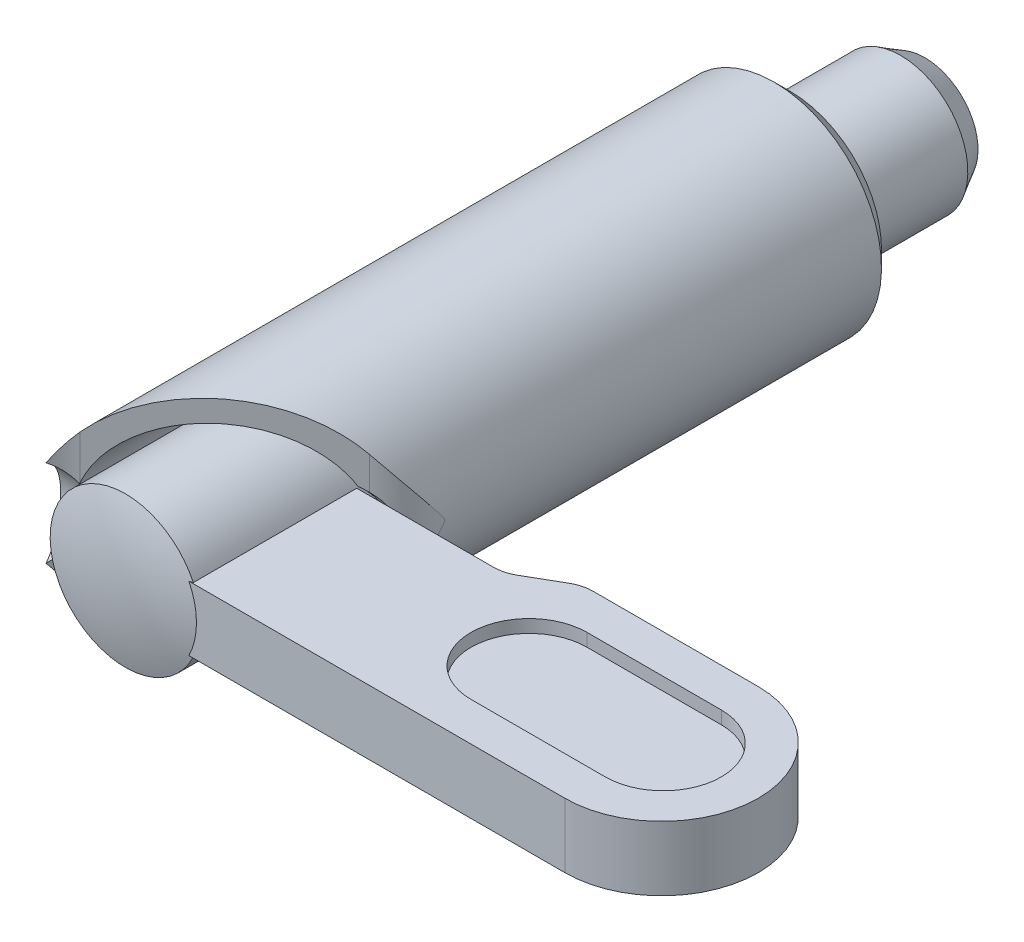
ISO-10303-21;
HEADER;
FILE_DESCRIPTION(('STEP AP214'),'2;1');
FILE_NAME('part.step','',(''),(''),'','','');
FILE_SCHEMA(('AUTOMOTIVE_DESIGN { 1 0 10303 214 1 1 1 1 }'));
ENDSEC;
DATA;
#1=APPLICATION_CONTEXT('core data for automotive mechanical design processes');
#2=APPLICATION_PROTOCOL_DEFINITION('international standard','automotive_design',2000,#1);
#3=PRODUCT_CONTEXT('',#1,'mechanical');
#4=PRODUCT('Part','Part','',(#3));
#5=PRODUCT_RELATED_PRODUCT_CATEGORY('part','',(#4));
#6=PRODUCT_DEFINITION_FORMATION('','',#4);
#7=PRODUCT_DEFINITION_CONTEXT('part definition',#1,'design');
#8=PRODUCT_DEFINITION('design','',#6,#7);
#9=PRODUCT_DEFINITION_SHAPE('','',#8);
#10=(LENGTH_UNIT() NAMED_UNIT(*) SI_UNIT(.MILLI.,.METRE.));
#11=(NAMED_UNIT(*) PLANE_ANGLE_UNIT() SI_UNIT($,.RADIAN.));
#12=(NAMED_UNIT(*) SI_UNIT($,.STERADIAN.) SOLID_ANGLE_UNIT());
#13=UNCERTAINTY_MEASURE_WITH_UNIT(LENGTH_MEASURE(1.E-05),#10,'distance_accuracy_value','');
#14=(GEOMETRIC_REPRESENTATION_CONTEXT(3) GLOBAL_UNCERTAINTY_ASSIGNED_CONTEXT((#13)) GLOBAL_UNIT_ASSIGNED_CONTEXT((#10,
#11,#12)) REPRESENTATION_CONTEXT('',''));
#15=CARTESIAN_POINT('',(0.,0.,0.));
#16=DIRECTION('',(0.,0.,1.));
#17=DIRECTION('',(1.,0.,0.));
#18=AXIS2_PLACEMENT_3D('',#15,#16,#17);
#19=CARTESIAN_POINT('',(-6.111214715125,32.,46.782847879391));
#20=DIRECTION('',(-0.606294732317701,0.,-0.795240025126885));
#21=DIRECTION('',(0.795240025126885,0.,-0.606294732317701));
#22=AXIS2_PLACEMENT_3D('',#19,#20,#21);
#23=PLANE('',#22);
#24=CARTESIAN_POINT('',(2.550610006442,0.,40.1790320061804));
#25=DIRECTION('',(-0.606294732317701,0.,-0.795240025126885));
#26=DIRECTION('',(-0.795240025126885,0.,0.606294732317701));
#27=AXIS2_PLACEMENT_3D('',#24,#25,#26);
#28=ELLIPSE('',#27,6.33355329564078,3.84000000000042);
#29=CARTESIAN_POINT('',(5.63382591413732,-3.03644620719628,37.82837370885));
#30=VERTEX_POINT('',#29);
#31=CARTESIAN_POINT('',(6.111214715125,-2.71595815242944,37.46441024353));
#32=VERTEX_POINT('',#31);
#33=EDGE_CURVE('E319',#30,#32,#28,.F.);
#34=ORIENTED_EDGE('',*,*,#33,.F.);
#35=CARTESIAN_POINT('',(0.,0.,42.1236290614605));
#36=DIRECTION('',(-0.606294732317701,0.,-0.795240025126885));
#37=DIRECTION('',(0.795240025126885,0.,-0.606294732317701));
#38=AXIS2_PLACEMENT_3D('',#35,#36,#37);
#39=ELLIPSE('',#38,8.04788466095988,6.4);
#40=CARTESIAN_POINT('',(-6.111214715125,-1.90080369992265,46.782847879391));
#41=VERTEX_POINT('',#40);
#42=EDGE_CURVE('E422',#30,#41,#39,.T.);
#43=ORIENTED_EDGE('',*,*,#42,.T.);
#44=DIRECTION('',(0.,-1.,0.));
#45=VECTOR('',#44,1.);
#46=CARTESIAN_POINT('',(-6.111214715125,32.,46.782847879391));
#47=LINE('',#46,#45);
#48=CARTESIAN_POINT('',(-6.111214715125,-5.16265965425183,46.782847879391));
#49=VERTEX_POINT('',#48);
#50=EDGE_CURVE('E431',#41,#49,#47,.T.);
#51=ORIENTED_EDGE('',*,*,#50,.T.);
#52=CARTESIAN_POINT('',(0.,0.,42.1236290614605));
#53=DIRECTION('',(-0.606294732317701,0.,-0.795240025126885));
#54=DIRECTION('',(0.795240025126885,0.,-0.606294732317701));
#55=AXIS2_PLACEMENT_3D('',#52,#53,#54);
#56=ELLIPSE('',#55,10.0598558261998,8.);
#57=CARTESIAN_POINT('',(6.111214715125,-5.16265965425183,37.46441024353));
#58=VERTEX_POINT('',#57);
#59=EDGE_CURVE('E451',#49,#58,#56,.F.);
#60=ORIENTED_EDGE('',*,*,#59,.T.);
#61=DIRECTION('',(0.,-1.,0.));
#62=VECTOR('',#61,1.);
#63=CARTESIAN_POINT('',(6.111214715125,32.,37.46441024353));
#64=LINE('',#63,#62);
#65=EDGE_CURVE('E427',#32,#58,#64,.T.);
#66=ORIENTED_EDGE('',*,*,#65,.F.);
#67=EDGE_LOOP('',(#34,#43,#51,#60,#66));
#68=FACE_BOUND('',#67,.T.);
#69=ADVANCED_FACE('F14',(#68),#23,.F.);
#70=CARTESIAN_POINT('',(3.20100000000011,32.,33.647258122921));
#71=DIRECTION('',(0.,-1.,0.));
#72=DIRECTION('',(1.,0.,0.));
#73=AXIS2_PLACEMENT_3D('',#70,#71,#72);
#74=CYLINDRICAL_SURFACE('',#73,4.79999999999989);
#75=CARTESIAN_POINT('',(6.111214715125,-2.71595815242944,37.46441024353));
#76=CARTESIAN_POINT('',(6.17056205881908,-2.67076879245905,37.4191825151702));
#77=CARTESIAN_POINT('',(6.22754131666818,-2.62287052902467,37.3735349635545));
#78=CARTESIAN_POINT('',(6.33655557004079,-2.52170275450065,37.2822693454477));
#79=CARTESIAN_POINT('',(6.38858992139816,-2.46843254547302,37.236651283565));
#80=CARTESIAN_POINT('',(6.48739955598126,-2.35668232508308,37.1464092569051));
#81=CARTESIAN_POINT('',(6.53418435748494,-2.29821209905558,37.1017836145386));
#82=CARTESIAN_POINT('',(6.62250899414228,-2.17620277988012,37.0143246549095));
#83=CARTESIAN_POINT('',(6.66404941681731,-2.11266425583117,36.9714911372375));
#84=CARTESIAN_POINT('',(6.74196353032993,-1.98072163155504,36.8883737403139));
#85=CARTESIAN_POINT('',(6.77832775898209,-1.91230895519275,36.8480946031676));
#86=CARTESIAN_POINT('',(6.84590535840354,-1.77112516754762,36.7709254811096));
#87=CARTESIAN_POINT('',(6.87711672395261,-1.69835237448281,36.7340368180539));
#88=CARTESIAN_POINT('',(6.93450895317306,-1.54903647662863,36.6643673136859));
#89=CARTESIAN_POINT('',(6.96069365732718,-1.47249630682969,36.6315833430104));
#90=CARTESIAN_POINT('',(7.00827152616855,-1.31612099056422,36.5706429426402));
#91=CARTESIAN_POINT('',(7.02966285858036,-1.23628459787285,36.5424882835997));
#92=CARTESIAN_POINT('',(7.06755165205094,-1.07521717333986,36.4916859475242));
#93=CARTESIAN_POINT('',(7.08412175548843,-0.994028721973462,36.4689575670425));
#94=CARTESIAN_POINT('',(7.11301230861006,-0.829609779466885,36.4287617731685));
#95=CARTESIAN_POINT('',(7.12533123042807,-0.746378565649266,36.4112962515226));
#96=CARTESIAN_POINT('',(7.15616310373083,-0.494442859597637,36.3671938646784));
#97=CARTESIAN_POINT('',(7.16856764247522,-0.323423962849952,36.3488281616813));
#98=CARTESIAN_POINT('',(7.17792604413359,0.0250726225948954,36.335031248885));
#99=CARTESIAN_POINT('',(7.17440085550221,0.202589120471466,36.3403110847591));
#100=CARTESIAN_POINT('',(7.15058349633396,0.554090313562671,36.3751201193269));
#101=CARTESIAN_POINT('',(7.13029371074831,0.72807550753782,36.4046458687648));
#102=CARTESIAN_POINT('',(7.0715272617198,1.06865519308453,36.4865473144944));
#103=CARTESIAN_POINT('',(7.03293193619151,1.23519359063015,36.5390719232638));
#104=CARTESIAN_POINT('',(6.93567669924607,1.55459525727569,36.6636110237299));
#105=CARTESIAN_POINT('',(6.87701902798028,1.70746005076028,36.7356233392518));
#106=CARTESIAN_POINT('',(6.73994159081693,1.99111383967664,36.8916926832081));
#107=CARTESIAN_POINT('',(6.66208689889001,2.12238060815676,36.9753798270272));
#108=CARTESIAN_POINT('',(6.48553667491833,2.36451981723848,37.1496973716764));
#109=CARTESIAN_POINT('',(6.38687083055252,2.47542089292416,37.2403177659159));
#110=CARTESIAN_POINT('',(6.25181009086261,2.60023753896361,37.3531710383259));
#111=CARTESIAN_POINT('',(6.2244711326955,2.62430003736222,37.375515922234));
#112=CARTESIAN_POINT('',(6.16868069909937,2.67110147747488,37.4200735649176));
#113=CARTESIAN_POINT('',(6.14023105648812,2.69384245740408,37.4422864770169));
#114=CARTESIAN_POINT('',(6.111214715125,2.71595815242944,37.46441024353));
#115=B_SPLINE_CURVE_WITH_KNOTS('',3,(#75,#76,#77,#78,#79,#80,#81,#82,#83,#84,#85,#86,#87,#88,
#89,#90,#91,#92,#93,#94,#95,#96,#97,#98,#99,#100,#101,#102,#103,#104,#105,#106,#107,#108,#109,
#110,#111,#112,#113,#114),.UNSPECIFIED.,.F.,.F.,(4,2,2,2,2,2,2,2,2,2,2,2,2,2,2,2,2,2,2,4),(0.,
0.261643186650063,0.523320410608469,0.784515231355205,1.04568076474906,1.30731774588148,
1.56905630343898,1.83059408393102,2.09223166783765,2.3496944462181,2.60724966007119,
3.12212982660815,3.65259521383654,4.18298514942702,4.71686122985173,5.25067771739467,
5.77034372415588,6.28927336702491,6.41743973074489,6.54540286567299),.UNSPECIFIED.);
#116=CARTESIAN_POINT('',(6.111214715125,2.71595815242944,37.46441024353));
#117=VERTEX_POINT('',#116);
#118=EDGE_CURVE('E311',#32,#117,#115,.T.);
#119=ORIENTED_EDGE('',*,*,#118,.F.);
#120=ORIENTED_EDGE('',*,*,#65,.T.);
#121=CARTESIAN_POINT('',(0.,8.,37.2240722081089));
#122=CARTESIAN_POINT('',(-0.0998530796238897,8.00000022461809,37.1347110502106));
#123=CARTESIAN_POINT('',(-0.195955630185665,7.99812938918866,37.0411697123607));
#124=CARTESIAN_POINT('',(-0.379987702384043,7.99150129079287,36.8463964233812));
#125=CARTESIAN_POINT('',(-0.467913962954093,7.9867428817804,36.7451614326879));
#126=CARTESIAN_POINT('',(-0.635067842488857,7.97519406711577,36.535609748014));
#127=CARTESIAN_POINT('',(-0.714282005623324,7.96840057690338,36.4272825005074));
#128=CARTESIAN_POINT('',(-0.863362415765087,7.95362938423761,36.2043935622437));
#129=CARTESIAN_POINT('',(-0.933224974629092,7.94565121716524,36.0898294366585));
#130=CARTESIAN_POINT('',(-1.06297904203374,7.92933443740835,35.8555113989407));
#131=CARTESIAN_POINT('',(-1.12289006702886,7.92099657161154,35.7357682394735));
#132=CARTESIAN_POINT('',(-1.2325300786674,7.90467864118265,35.4916340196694));
#133=CARTESIAN_POINT('',(-1.28225557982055,7.89669869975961,35.3672413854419));
#134=CARTESIAN_POINT('',(-1.37112117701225,7.88175470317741,35.1147741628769));
#135=CARTESIAN_POINT('',(-1.41026912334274,7.87478989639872,34.9867023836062));
#136=CARTESIAN_POINT('',(-1.47774242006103,7.86240773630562,34.7276662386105));
#137=CARTESIAN_POINT('',(-1.50606796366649,7.8569903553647,34.5967019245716));
#138=CARTESIAN_POINT('',(-1.55183492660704,7.84807984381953,34.3319006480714));
#139=CARTESIAN_POINT('',(-1.56920113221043,7.84460002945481,34.1980502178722));
#140=CARTESIAN_POINT('',(-1.5925990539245,7.83988337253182,33.929368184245));
#141=CARTESIAN_POINT('',(-1.59863463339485,7.83864576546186,33.7945369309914));
#142=CARTESIAN_POINT('',(-1.59933323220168,7.83850325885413,33.5248184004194));
#143=CARTESIAN_POINT('',(-1.59399411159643,7.83959879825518,33.3899311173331));
#144=CARTESIAN_POINT('',(-1.57198310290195,7.84404198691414,33.1211235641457));
#145=CARTESIAN_POINT('',(-1.55531132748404,7.84738961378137,32.987203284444));
#146=CARTESIAN_POINT('',(-1.51117738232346,7.85600642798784,32.7237323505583));
#147=CARTESIAN_POINT('',(-1.48391750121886,7.86123946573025,32.5941465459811));
#148=CARTESIAN_POINT('',(-1.41879665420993,7.87325291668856,32.3376817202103));
#149=CARTESIAN_POINT('',(-1.38093112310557,7.88003399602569,32.2108038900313));
#150=CARTESIAN_POINT('',(-1.29487457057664,7.89463125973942,31.96066195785));
#151=CARTESIAN_POINT('',(-1.24668348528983,7.90244745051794,31.8373978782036));
#152=CARTESIAN_POINT('',(-1.14030295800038,7.91849739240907,31.5952901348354));
#153=CARTESIAN_POINT('',(-1.08211337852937,7.92673114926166,31.4764465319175));
#154=CARTESIAN_POINT('',(-0.955027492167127,7.94305329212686,31.241946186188));
#155=CARTESIAN_POINT('',(-0.885963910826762,7.95113672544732,31.126379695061));
#156=CARTESIAN_POINT('',(-0.738366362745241,7.96619820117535,30.9014466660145));
#157=CARTESIAN_POINT('',(-0.65983604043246,7.97317666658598,30.7920777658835));
#158=CARTESIAN_POINT('',(-0.493771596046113,7.98518131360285,30.5802097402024));
#159=CARTESIAN_POINT('',(-0.406233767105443,7.9902066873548,30.4777134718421));
#160=CARTESIAN_POINT('',(-0.222829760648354,7.99742225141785,30.2804317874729));
#161=CARTESIAN_POINT('',(-0.126967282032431,7.99961369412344,30.1856429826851));
#162=CARTESIAN_POINT('',(0.0715198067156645,8.00029025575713,30.0052563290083));
#163=CARTESIAN_POINT('',(0.174077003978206,7.99880802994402,29.9195845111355));
#164=CARTESIAN_POINT('',(0.385833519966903,7.99139210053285,29.757189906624));
#165=CARTESIAN_POINT('',(0.495029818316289,7.9854604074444,29.6804630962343));
#166=CARTESIAN_POINT('',(0.719098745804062,7.96840720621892,29.5365541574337));
#167=CARTESIAN_POINT('',(0.833968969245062,7.95728788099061,29.4693680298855));
#168=CARTESIAN_POINT('',(1.0683267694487,7.92922435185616,29.345014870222));
#169=CARTESIAN_POINT('',(1.18781397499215,7.91228061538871,29.2878470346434));
#170=CARTESIAN_POINT('',(1.42108346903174,7.87359087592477,29.1877990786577));
#171=CARTESIAN_POINT('',(1.53462030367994,7.8523010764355,29.1441683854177));
#172=CARTESIAN_POINT('',(1.76362887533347,7.8040571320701,29.065925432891));
#173=CARTESIAN_POINT('',(1.87910124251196,7.77710110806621,29.0313161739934));
#174=CARTESIAN_POINT('',(2.11084112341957,7.71742566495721,28.9711616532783));
#175=CARTESIAN_POINT('',(2.2271081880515,7.68470927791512,28.9456116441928));
#176=CARTESIAN_POINT('',(2.45953229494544,7.6135063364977,28.9034008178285));
#177=CARTESIAN_POINT('',(2.57568928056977,7.57501765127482,28.8867432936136));
#178=CARTESIAN_POINT('',(2.80355385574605,7.49361718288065,28.8624086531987));
#179=CARTESIAN_POINT('',(2.91529283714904,7.45086590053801,28.8544852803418));
#180=CARTESIAN_POINT('',(3.13701141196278,7.36026549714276,28.8464022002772));
#181=CARTESIAN_POINT('',(3.24699031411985,7.31241442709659,28.8462454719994));
#182=CARTESIAN_POINT('',(3.4644906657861,7.21191079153,28.8532605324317));
#183=CARTESIAN_POINT('',(3.57201199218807,7.15925798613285,28.8604326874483));
#184=CARTESIAN_POINT('',(3.78406437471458,7.04947666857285,28.88161066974));
#185=CARTESIAN_POINT('',(3.88859480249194,6.99234722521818,28.8956179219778));
#186=CARTESIAN_POINT('',(4.13245206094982,6.85195636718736,28.9363307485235));
#187=CARTESIAN_POINT('',(4.27027368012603,6.76687361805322,28.965820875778));
#188=CARTESIAN_POINT('',(4.53867448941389,6.58986371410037,29.0353321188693));
#189=CARTESIAN_POINT('',(4.66925151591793,6.49793453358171,29.0753563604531));
#190=CARTESIAN_POINT('',(4.92283518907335,6.30799661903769,29.164694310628));
#191=CARTESIAN_POINT('',(5.04583156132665,6.20997998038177,29.2140202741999));
#192=CARTESIAN_POINT('',(5.28384647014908,6.00876593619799,29.3207388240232));
#193=CARTESIAN_POINT('',(5.39886266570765,5.90556702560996,29.3781337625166));
#194=CARTESIAN_POINT('',(5.66265905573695,5.65497190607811,29.5228650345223));
#195=CARTESIAN_POINT('',(5.80782997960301,5.5055752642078,29.6133340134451));
#196=CARTESIAN_POINT('',(6.08301233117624,5.19993122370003,29.8051038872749));
#197=CARTESIAN_POINT('',(6.21301824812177,5.0436813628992,29.9064086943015));
#198=CARTESIAN_POINT('',(6.45841964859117,4.72538521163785,30.1180216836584));
#199=CARTESIAN_POINT('',(6.57378934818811,4.56332931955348,30.2283452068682));
#200=CARTESIAN_POINT('',(6.79010087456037,4.23476354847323,30.4561722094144));
#201=CARTESIAN_POINT('',(6.89104275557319,4.06825368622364,30.5736756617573));
#202=CARTESIAN_POINT('',(7.11489929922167,3.66731444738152,30.8605098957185));
#203=CARTESIAN_POINT('',(7.23148136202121,3.43123368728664,31.0324946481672));
#204=CARTESIAN_POINT('',(7.43920503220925,2.95398054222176,31.3846426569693));
#205=CARTESIAN_POINT('',(7.53033550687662,2.71280597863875,31.5648094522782));
#206=CARTESIAN_POINT('',(7.68793983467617,2.22724420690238,31.9305898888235));
#207=CARTESIAN_POINT('',(7.75445309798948,1.982862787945,32.116194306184));
#208=CARTESIAN_POINT('',(7.86372040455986,1.4917100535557,32.4909168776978));
#209=CARTESIAN_POINT('',(7.90648367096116,1.24493970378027,32.6800336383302));
#210=CARTESIAN_POINT('',(7.95690174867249,0.843604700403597,32.9873269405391));
#211=CARTESIAN_POINT('',(7.97172376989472,0.689672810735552,33.1051238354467));
#212=CARTESIAN_POINT('',(7.98813143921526,0.444877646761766,33.2894942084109));
#213=CARTESIAN_POINT('',(7.99266153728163,0.354660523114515,33.3568155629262));
#214=CARTESIAN_POINT('',(7.99719398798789,0.2168310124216,33.4536846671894));
#215=CARTESIAN_POINT('',(7.99832742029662,0.170829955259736,33.4850652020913));
#216=CARTESIAN_POINT('',(7.99926967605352,0.108844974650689,33.5181697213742));
#217=CARTESIAN_POINT('',(7.99944001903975,0.0956228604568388,33.5247503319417));
#218=CARTESIAN_POINT('',(7.99971852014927,0.0684686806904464,33.5362108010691));
#219=CARTESIAN_POINT('',(7.99982696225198,0.0545401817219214,33.5410983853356));
#220=CARTESIAN_POINT('',(7.99994836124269,0.0303728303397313,33.5467557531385));
#221=CARTESIAN_POINT('',(7.99998054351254,0.0203369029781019,33.548334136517));
#222=CARTESIAN_POINT('',(8.00000631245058,0.000171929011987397,33.5495903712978));
#223=CARTESIAN_POINT('',(8.00000003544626,-0.00995666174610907,33.5492749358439));
#224=CARTESIAN_POINT('',(7.99994369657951,-0.0325579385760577,33.5465558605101));
#225=CARTESIAN_POINT('',(7.99988279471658,-0.044963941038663,33.5436362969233));
#226=CARTESIAN_POINT('',(7.9997096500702,-0.0692359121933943,33.5358931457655));
#227=CARTESIAN_POINT('',(7.99959692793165,-0.0810956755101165,33.5310518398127));
#228=CARTESIAN_POINT('',(7.99889430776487,-0.141929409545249,33.5034821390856));
#229=CARTESIAN_POINT('',(7.99793793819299,-0.187241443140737,33.4734226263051));
#230=CARTESIAN_POINT('',(7.99533695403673,-0.276609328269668,33.4118907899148));
#231=CARTESIAN_POINT('',(7.99368929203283,-0.320658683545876,33.3804127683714));
#232=CARTESIAN_POINT('',(7.98775187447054,-0.450982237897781,33.2854765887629));
#233=CARTESIAN_POINT('',(7.98245339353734,-0.536474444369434,33.2208133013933));
#234=CARTESIAN_POINT('',(7.96914726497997,-0.70708349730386,33.0912939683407));
#235=CARTESIAN_POINT('',(7.96113748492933,-0.792199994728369,33.0264378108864));
#236=CARTESIAN_POINT('',(7.9424197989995,-0.961899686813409,32.8967982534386));
#237=CARTESIAN_POINT('',(7.93171843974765,-1.04648367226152,32.8320150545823));
#238=CARTESIAN_POINT('',(7.90759762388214,-1.21538870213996,32.702653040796));
#239=CARTESIAN_POINT('',(7.89417846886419,-1.29970977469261,32.6380742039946));
#240=CARTESIAN_POINT('',(7.8342494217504,-1.64093350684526,32.3769389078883));
#241=CARTESIAN_POINT('',(7.77635039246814,-1.89685175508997,32.1815409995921));
#242=CARTESIAN_POINT('',(7.63435054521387,-2.40550767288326,31.7958518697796));
#243=CARTESIAN_POINT('',(7.550231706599,-2.65824303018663,31.6055642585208));
#244=CARTESIAN_POINT('',(7.35469981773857,-3.15923204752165,31.2324785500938));
#245=CARTESIAN_POINT('',(7.24325709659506,-3.40748051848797,31.0496888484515));
#246=CARTESIAN_POINT('',(6.99203487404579,-3.89707028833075,30.6950943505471));
#247=CARTESIAN_POINT('',(6.85227648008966,-4.13841658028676,30.523281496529));
#248=CARTESIAN_POINT('',(6.50867087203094,-4.66436237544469,30.157951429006));
#249=CARTESIAN_POINT('',(6.2974880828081,-4.94678809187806,29.9679821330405));
#250=CARTESIAN_POINT('',(5.94600566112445,-5.3551133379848,29.7069301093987));
#251=CARTESIAN_POINT('',(5.82313340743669,-5.48860376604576,29.6239335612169));
#252=CARTESIAN_POINT('',(5.56554836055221,-5.74963130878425,29.4673513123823));
#253=CARTESIAN_POINT('',(5.43083740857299,-5.87716934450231,29.3937641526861));
#254=CARTESIAN_POINT('',(5.18015829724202,-6.09815605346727,29.2725713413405));
#255=CARTESIAN_POINT('',(5.06646358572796,-6.19299796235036,29.2227924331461));
#256=CARTESIAN_POINT('',(4.83201441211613,-6.37760796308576,29.1311062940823));
#257=CARTESIAN_POINT('',(4.71126179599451,-6.46737736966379,29.0891970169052));
#258=CARTESIAN_POINT('',(4.46308546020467,-6.64106847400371,29.0143404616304));
#259=CARTESIAN_POINT('',(4.33566688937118,-6.72499457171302,28.9813863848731));
#260=CARTESIAN_POINT('',(4.07461643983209,-6.88629244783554,28.9255424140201));
#261=CARTESIAN_POINT('',(3.94098572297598,-6.9636654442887,28.9026506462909));
#262=CARTESIAN_POINT('',(3.69258220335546,-7.09796306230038,28.8711599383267));
#263=CARTESIAN_POINT('',(3.57868114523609,-7.15607736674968,28.860743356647));
#264=CARTESIAN_POINT('',(3.34785599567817,-7.26692798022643,28.8481137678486));
#265=CARTESIAN_POINT('',(3.23093251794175,-7.31966537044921,28.8458991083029));
#266=CARTESIAN_POINT('',(2.99485535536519,-7.41938362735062,28.8502344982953));
#267=CARTESIAN_POINT('',(2.87570251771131,-7.46636663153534,28.8567812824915));
#268=CARTESIAN_POINT('',(2.63603406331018,-7.55431111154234,28.8791037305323));
#269=CARTESIAN_POINT('',(2.51551842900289,-7.5952725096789,28.8948795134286));
#270=CARTESIAN_POINT('',(2.2736299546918,-7.6711631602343,28.9360903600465));
#271=CARTESIAN_POINT('',(2.15225568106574,-7.70606492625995,28.9615678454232));
#272=CARTESIAN_POINT('',(1.91032107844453,-7.76957625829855,29.0223577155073));
#273=CARTESIAN_POINT('',(1.7897607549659,-7.79818578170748,29.0576701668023));
#274=CARTESIAN_POINT('',(1.55063296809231,-7.84923476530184,29.1381336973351));
#275=CARTESIAN_POINT('',(1.43206551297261,-7.87167419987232,29.1832848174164));
#276=CARTESIAN_POINT('',(1.19808653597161,-7.91066720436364,29.2832552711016));
#277=CARTESIAN_POINT('',(1.08267487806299,-7.92722102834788,29.338074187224));
#278=CARTESIAN_POINT('',(0.864249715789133,-7.95388570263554,29.452773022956));
#279=CARTESIAN_POINT('',(0.760941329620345,-7.96437414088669,29.5120059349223));
#280=CARTESIAN_POINT('',(0.558740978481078,-7.98110918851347,29.6381842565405));
#281=CARTESIAN_POINT('',(0.459850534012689,-7.98735434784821,29.7051322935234));
#282=CARTESIAN_POINT('',(0.267261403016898,-7.99611549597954,29.8462808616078));
#283=CARTESIAN_POINT('',(0.173561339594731,-7.99863247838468,29.9204794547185));
#284=CARTESIAN_POINT('',(-0.00809034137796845,-8.00051185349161,30.0757009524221));
#285=CARTESIAN_POINT('',(-0.096039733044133,-7.99987303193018,30.1567264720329));
#286=CARTESIAN_POINT('',(-0.269203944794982,-7.99595798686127,30.3286460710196));
#287=CARTESIAN_POINT('',(-0.354146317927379,-7.99257149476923,30.4198124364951));
#288=CARTESIAN_POINT('',(-0.516657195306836,-7.98371409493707,30.6084186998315));
#289=CARTESIAN_POINT('',(-0.594222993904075,-7.97824242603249,30.7058608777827));
#290=CARTESIAN_POINT('',(-0.815131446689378,-7.95973720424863,31.0067105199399));
#291=CARTESIAN_POINT('',(-0.946793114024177,-7.94460935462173,31.2187484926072));
#292=CARTESIAN_POINT('',(-1.18389254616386,-7.91288922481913,31.6764946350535));
#293=CARTESIAN_POINT('',(-1.2867598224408,-7.89626992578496,31.9235278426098));
#294=CARTESIAN_POINT('',(-1.45014338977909,-7.86790974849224,32.4315244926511));
#295=CARTESIAN_POINT('',(-1.51066157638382,-7.85616865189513,32.6924873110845));
#296=CARTESIAN_POINT('',(-1.58780129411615,-7.84094983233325,33.2231853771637));
#297=CARTESIAN_POINT('',(-1.60407405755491,-7.83753778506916,33.4929734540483));
#298=CARTESIAN_POINT('',(-1.59117353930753,-7.84016589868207,34.0314092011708));
#299=CARTESIAN_POINT('',(-1.56200222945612,-7.84620564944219,34.3000569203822));
#300=CARTESIAN_POINT('',(-1.46004843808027,-7.86580288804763,34.8240182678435));
#301=CARTESIAN_POINT('',(-1.38798483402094,-7.87923618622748,35.0794778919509));
#302=CARTESIAN_POINT('',(-1.20281076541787,-7.90961361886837,35.5750424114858));
#303=CARTESIAN_POINT('',(-1.08968950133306,-7.92655867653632,35.8151432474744));
#304=CARTESIAN_POINT('',(-0.890418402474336,-7.95057898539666,36.1609250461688));
#305=CARTESIAN_POINT('',(-0.818223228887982,-7.95842111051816,36.2748112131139));
#306=CARTESIAN_POINT('',(-0.664476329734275,-7.97273082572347,36.4961557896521));
#307=CARTESIAN_POINT('',(-0.58292826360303,-7.97919895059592,36.6036166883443));
#308=CARTESIAN_POINT('',(-0.41098726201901,-7.9899003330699,36.8113924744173));
#309=CARTESIAN_POINT('',(-0.320591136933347,-7.99413278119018,36.9117047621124));
#310=CARTESIAN_POINT('',(-0.13165954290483,-7.9994743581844,37.1043624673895));
#311=CARTESIAN_POINT('',(-0.0331277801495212,-8.00058490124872,37.1967114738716));
#312=CARTESIAN_POINT('',(0.16983964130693,-7.99883109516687,37.3714674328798));
#313=CARTESIAN_POINT('',(0.274166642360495,-7.99602519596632,37.4540010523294));
#314=CARTESIAN_POINT('',(0.48911670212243,-7.98575813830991,37.6099987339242));
#315=CARTESIAN_POINT('',(0.599736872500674,-7.97829910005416,37.683466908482));
#316=CARTESIAN_POINT('',(0.826276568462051,-7.95802687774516,37.8207727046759));
#317=CARTESIAN_POINT('',(0.942193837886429,-7.94521595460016,37.8846143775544));
#318=CARTESIAN_POINT('',(1.17824502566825,-7.9136534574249,38.002237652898));
#319=CARTESIAN_POINT('',(1.29837861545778,-7.89490234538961,38.0560200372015));
#320=CARTESIAN_POINT('',(1.53230529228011,-7.85271073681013,38.1494895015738));
#321=CARTESIAN_POINT('',(1.64587853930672,-7.82973986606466,38.1899410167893));
#322=CARTESIAN_POINT('',(1.87460579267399,-7.77814884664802,38.2619147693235));
#323=CARTESIAN_POINT('',(1.98976030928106,-7.74952683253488,38.2934340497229));
#324=CARTESIAN_POINT('',(2.22053950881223,-7.68657939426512,38.3475494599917));
#325=CARTESIAN_POINT('',(2.33616394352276,-7.65225667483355,38.3701498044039));
#326=CARTESIAN_POINT('',(2.56700510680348,-7.57794139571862,38.4066396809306));
#327=CARTESIAN_POINT('',(2.68222166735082,-7.53794672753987,38.4205259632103));
#328=CARTESIAN_POINT('',(2.90902857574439,-7.45331495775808,38.4396941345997));
#329=CARTESIAN_POINT('',(3.02064543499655,-7.40878622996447,38.4451419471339));
#330=CARTESIAN_POINT('',(3.2418653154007,-7.31469702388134,38.4483608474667));
#331=CARTESIAN_POINT('',(3.35146754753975,-7.26513462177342,38.4461289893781));
#332=CARTESIAN_POINT('',(3.67627863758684,-7.10932230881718,38.4285807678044));
#333=CARTESIAN_POINT('',(3.88760031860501,-6.99590679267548,38.4024199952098));
#334=CARTESIAN_POINT('',(4.23386310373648,-6.78984194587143,38.3370591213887));
#335=CARTESIAN_POINT('',(4.37257215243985,-6.70128900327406,38.3041972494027));
#336=CARTESIAN_POINT('',(4.64234584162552,-6.51730598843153,38.2278868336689));
#337=CARTESIAN_POINT('',(4.77340806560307,-6.42187376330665,38.184434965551));
#338=CARTESIAN_POINT('',(5.15470715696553,-6.12636614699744,38.0400890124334));
#339=CARTESIAN_POINT('',(5.39282166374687,-5.91722146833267,37.9252530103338));
#340=CARTESIAN_POINT('',(5.76683202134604,-5.54886436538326,37.7077821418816));
#341=CARTESIAN_POINT('',(5.91161302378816,-5.39413031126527,37.6122958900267));
#342=CARTESIAN_POINT('',(6.18544702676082,-5.07779110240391,37.4104990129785));
#343=CARTESIAN_POINT('',(6.31449418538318,-4.91618342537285,37.3041843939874));
#344=CARTESIAN_POINT('',(6.55736652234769,-4.58724764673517,37.0826447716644));
#345=CARTESIAN_POINT('',(6.67116497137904,-4.41991012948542,36.9674046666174));
#346=CARTESIAN_POINT('',(6.88379422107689,-4.08085932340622,36.7298590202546));
#347=CARTESIAN_POINT('',(6.98262531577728,-3.90914612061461,36.607553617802));
#348=CARTESIAN_POINT('',(7.20009866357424,-3.49731913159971,36.3104587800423));
#349=CARTESIAN_POINT('',(7.31233444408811,-3.25563292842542,36.1331419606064));
#350=CARTESIAN_POINT('',(7.51073043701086,-2.76738521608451,35.7706764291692));
#351=CARTESIAN_POINT('',(7.59687770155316,-2.52082135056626,35.5855238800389));
#352=CARTESIAN_POINT('',(7.74386748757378,-2.02467503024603,35.2102541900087));
#353=CARTESIAN_POINT('',(7.80475011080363,-1.7750980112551,35.0201454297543));
#354=CARTESIAN_POINT('',(7.90205699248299,-1.27387074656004,34.6366927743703));
#355=CARTESIAN_POINT('',(7.93849775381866,-1.0222220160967,34.4433511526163));
#356=CARTESIAN_POINT('',(7.97508892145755,-0.643356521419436,34.1546772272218));
#357=CARTESIAN_POINT('',(7.98427365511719,-0.517176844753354,34.0589311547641));
#358=CARTESIAN_POINT('',(7.99372899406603,-0.323675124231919,33.9156414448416));
#359=CARTESIAN_POINT('',(7.99616239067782,-0.25731519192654,33.8671202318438));
#360=CARTESIAN_POINT('',(7.99819222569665,-0.170907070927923,33.8118146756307));
#361=CARTESIAN_POINT('',(7.99854696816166,-0.153493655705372,33.8010448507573));
#362=CARTESIAN_POINT('',(7.99915200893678,-0.11785011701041,33.7808059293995));
#363=CARTESIAN_POINT('',(7.99940223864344,-0.0996194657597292,33.7713376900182));
#364=CARTESIAN_POINT('',(7.99969733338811,-0.0703460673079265,33.7591670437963));
#365=CARTESIAN_POINT('',(7.99978387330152,-0.0597908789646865,33.7553431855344));
#366=CARTESIAN_POINT('',(7.99991562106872,-0.0382708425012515,33.7493263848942));
#367=CARTESIAN_POINT('',(7.99996111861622,-0.0273094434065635,33.7471220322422));
#368=CARTESIAN_POINT('',(8.00000630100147,-0.00497944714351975,33.7449326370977));
#369=CARTESIAN_POINT('',(8.0000053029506,0.00639276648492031,33.744980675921));
#370=CARTESIAN_POINT('',(7.99995572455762,0.0289219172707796,33.7473842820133));
#371=CARTESIAN_POINT('',(7.99990690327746,0.0400774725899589,33.7497515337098));
#372=CARTESIAN_POINT('',(7.99968891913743,0.0743517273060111,33.7596171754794));
#373=CARTESIAN_POINT('',(7.99944599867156,0.0965859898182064,33.7698880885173));
#374=CARTESIAN_POINT('',(7.99880683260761,0.139859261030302,33.7928292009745));
#375=CARTESIAN_POINT('',(7.99840886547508,0.160881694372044,33.8055254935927));
#376=CARTESIAN_POINT('',(7.99684970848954,0.229569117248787,33.8490869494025));
#377=CARTESIAN_POINT('',(7.99537232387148,0.275990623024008,33.8819287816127));
#378=CARTESIAN_POINT('',(7.99165642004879,0.368145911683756,33.9485203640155));
#379=CARTESIAN_POINT('',(7.9894168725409,0.413878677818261,33.9822712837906));
#380=CARTESIAN_POINT('',(7.98419422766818,0.504679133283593,34.0499855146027));
#381=CARTESIAN_POINT('',(7.98121633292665,0.549749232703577,34.0839457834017));
#382=CARTESIAN_POINT('',(7.97451118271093,0.639687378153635,34.152000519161));
#383=CARTESIAN_POINT('',(7.97078431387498,0.68455551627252,34.1860949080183));
#384=CARTESIAN_POINT('',(7.95015845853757,0.909867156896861,34.3576261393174));
#385=CARTESIAN_POINT('',(7.92753871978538,1.08953982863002,34.4954504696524));
#386=CARTESIAN_POINT('',(7.86997349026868,1.44790138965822,34.7699413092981));
#387=CARTESIAN_POINT('',(7.83502238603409,1.62658979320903,34.9066072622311));
#388=CARTESIAN_POINT('',(7.7524595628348,1.98317570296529,35.1784145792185));
#389=CARTESIAN_POINT('',(7.70480641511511,2.16106864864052,35.3135494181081));
#390=CARTESIAN_POINT('',(7.59662964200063,2.51504668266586,35.5809720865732));
#391=CARTESIAN_POINT('',(7.53610760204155,2.69113199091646,35.7132602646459));
#392=CARTESIAN_POINT('',(7.40168266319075,3.04144353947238,35.9744649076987));
#393=CARTESIAN_POINT('',(7.32774685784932,3.21566406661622,36.1033721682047));
#394=CARTESIAN_POINT('',(7.16618550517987,3.56120280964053,36.3564737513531));
#395=CARTESIAN_POINT('',(7.07855878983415,3.73252077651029,36.4806676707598));
#396=CARTESIAN_POINT('',(6.88924630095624,4.07135140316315,36.7230442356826));
#397=CARTESIAN_POINT('',(6.78757428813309,4.23886760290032,36.8412326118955));
#398=CARTESIAN_POINT('',(6.56967350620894,4.56930651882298,37.070271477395));
#399=CARTESIAN_POINT('',(6.45344758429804,4.73223012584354,37.1811233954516));
#400=CARTESIAN_POINT('',(6.12902796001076,5.15195314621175,37.4599579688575));
#401=CARTESIAN_POINT('',(5.90851382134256,5.40428140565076,37.6207158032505));
#402=CARTESIAN_POINT('',(5.4266163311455,5.88796481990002,37.9093469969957));
#403=CARTESIAN_POINT('',(5.16527567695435,6.11934149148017,38.0372543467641));
#404=CARTESIAN_POINT('',(4.66181041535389,6.50737898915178,38.2256992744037));
#405=CARTESIAN_POINT('',(4.42720983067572,6.6695179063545,38.2947489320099));
#406=CARTESIAN_POINT('',(4.05924476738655,6.89516562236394,38.3715713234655));
#407=CARTESIAN_POINT('',(3.93393286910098,6.96744499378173,38.3927189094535));
#408=CARTESIAN_POINT('',(3.67855040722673,7.1055823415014,38.4251754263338));
#409=CARTESIAN_POINT('',(3.54848055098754,7.17144126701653,38.4364858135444));
#410=CARTESIAN_POINT('',(3.30417355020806,7.28682965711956,38.4474670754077));
#411=CARTESIAN_POINT('',(3.19045983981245,7.33733081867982,38.4486192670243));
#412=CARTESIAN_POINT('',(2.96098845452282,7.43289883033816,38.4426268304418));
#413=CARTESIAN_POINT('',(2.84523108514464,7.47796648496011,38.4354834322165));
#414=CARTESIAN_POINT('',(2.61251240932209,7.56241369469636,38.4124813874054));
#415=CARTESIAN_POINT('',(2.49555116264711,7.6017935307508,38.3966231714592));
#416=CARTESIAN_POINT('',(2.26137177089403,7.67471406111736,38.3558908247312));
#417=CARTESIAN_POINT('',(2.14415362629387,7.70825476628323,38.3310167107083));
#418=CARTESIAN_POINT('',(1.91012984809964,7.76956115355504,38.2720024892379));
#419=CARTESIAN_POINT('',(1.79332659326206,7.79730875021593,38.2378341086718));
#420=CARTESIAN_POINT('',(1.56157079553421,7.84700854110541,38.1602619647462));
#421=CARTESIAN_POINT('',(1.44661821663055,7.86896084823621,38.1168583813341));
#422=CARTESIAN_POINT('',(1.21970768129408,7.90730950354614,38.021002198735));
#423=CARTESIAN_POINT('',(1.10774740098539,7.9237102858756,37.9685568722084));
#424=CARTESIAN_POINT('',(0.887759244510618,7.9513630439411,37.8548993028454));
#425=CARTESIAN_POINT('',(0.779730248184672,7.96261649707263,37.7936895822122));
#426=CARTESIAN_POINT('',(0.554865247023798,7.98163138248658,37.6544556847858));
#427=CARTESIAN_POINT('',(0.438686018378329,7.98875669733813,37.5752812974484));
#428=CARTESIAN_POINT('',(0.213629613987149,7.99794040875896,37.4069608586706));
#429=CARTESIAN_POINT('',(0.104751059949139,7.99999976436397,37.3178166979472));
#430=CARTESIAN_POINT('',(0.,8.,37.2240722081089));
#431=B_SPLINE_CURVE_WITH_KNOTS('',3,(#121,#122,#123,#124,#125,#126,#127,#128,#129,#130,#131,
#132,#133,#134,#135,#136,#137,#138,#139,#140,#141,#142,#143,#144,#145,#146,#147,#148,#149,#150,
#151,#152,#153,#154,#155,#156,#157,#158,#159,#160,#161,#162,#163,#164,#165,#166,#167,#168,#169,
#170,#171,#172,#173,#174,#175,#176,#177,#178,#179,#180,#181,#182,#183,#184,#185,#186,#187,#188,
#189,#190,#191,#192,#193,#194,#195,#196,#197,#198,#199,#200,#201,#202,#203,#204,#205,#206,#207,
#208,#209,#210,#211,#212,#213,#214,#215,#216,#217,#218,#219,#220,#221,#222,#223,#224,#225,#226,
#227,#228,#229,#230,#231,#232,#233,#234,#235,#236,#237,#238,#239,#240,#241,#242,#243,#244,#245,
#246,#247,#248,#249,#250,#251,#252,#253,#254,#255,#256,#257,#258,#259,#260,#261,#262,#263,#264,
#265,#266,#267,#268,#269,#270,#271,#272,#273,#274,#275,#276,#277,#278,#279,#280,#281,#282,#283,
#284,#285,#286,#287,#288,#289,#290,#291,#292,#293,#294,#295,#296,#297,#298,#299,#300,#301,#302,
#303,#304,#305,#306,#307,#308,#309,#310,#311,#312,#313,#314,#315,#316,#317,#318,#319,#320,#321,
#322,#323,#324,#325,#326,#327,#328,#329,#330,#331,#332,#333,#334,#335,#336,#337,#338,#339,#340,
#341,#342,#343,#344,#345,#346,#347,#348,#349,#350,#351,#352,#353,#354,#355,#356,#357,#358,#359,
#360,#361,#362,#363,#364,#365,#366,#367,#368,#369,#370,#371,#372,#373,#374,#375,#376,#377,#378,
#379,#380,#381,#382,#383,#384,#385,#386,#387,#388,#389,#390,#391,#392,#393,#394,#395,#396,#397,
#398,#399,#400,#401,#402,#403,#404,#405,#406,#407,#408,#409,#410,#411,#412,#413,#414,#415,#416,
#417,#418,#419,#420,#421,#422,#423,#424,#425,#426,#427,#428,#429,#430),.UNSPECIFIED.,.T.,.F.,(4,
2,2,2,2,2,2,2,2,2,2,2,2,2,2,2,2,2,2,2,2,2,2,2,2,2,2,2,2,2,2,2,2,2,2,2,2,2,2,2,2,2,2,2,2,2,2,2,2,
2,2,2,2,2,2,2,2,2,2,2,2,2,2,2,2,2,2,2,2,2,2,2,2,2,2,2,2,2,2,2,2,2,2,2,2,2,2,2,2,2,2,2,2,2,2,2,2,
2,2,2,2,2,2,2,2,2,2,2,2,2,2,2,2,2,2,2,2,2,2,2,2,2,2,2,2,2,2,2,2,2,2,2,2,2,2,2,2,2,2,2,2,2,2,2,2,
2,2,2,2,2,2,2,2,2,4),(0.,0.401864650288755,0.803888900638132,1.20652560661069,1.60932064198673,
2.01131616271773,2.41344901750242,2.81528259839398,3.21710900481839,3.62166397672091,
4.02608098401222,4.43057408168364,4.83506315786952,5.23217700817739,5.62946205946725,
6.02674956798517,6.42404253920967,6.82818417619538,7.23217072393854,7.6363241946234,
8.04029899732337,8.44069576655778,8.8409117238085,9.24095942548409,9.64097502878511,
10.0109499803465,10.3810478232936,10.7509514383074,11.1209919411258,11.4803089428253,
11.839763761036,12.1992365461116,12.5587843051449,13.0519509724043,13.5452641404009,
14.0392318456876,14.5333438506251,15.213653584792,15.8942097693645,16.5759486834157,
17.2576850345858,18.1997996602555,19.1423257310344,20.0833362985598,21.0239811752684,
21.6068134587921,21.9450201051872,22.1116058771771,22.1558686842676,22.1999267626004,
22.230254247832,22.2604742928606,22.2984622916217,22.3368089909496,22.4988299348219,
22.6615727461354,22.9832754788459,23.3052318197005,23.6264125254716,23.9475576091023,
24.9278233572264,25.9087643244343,26.8907752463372,27.8720568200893,29.0693501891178,
29.6673721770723,30.2653013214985,30.7335215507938,31.201619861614,31.6693617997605,
32.1370166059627,32.5215185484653,32.90594302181,33.2902242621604,33.6745104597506,
34.0604966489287,34.446485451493,34.8324758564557,35.2184495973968,35.5766799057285,
35.935032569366,36.2932897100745,36.6516847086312,37.0252189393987,37.3988896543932,
38.1457791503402,38.9464419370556,39.7470688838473,40.553988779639,41.3608736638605,
42.1546015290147,42.9485383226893,43.3533491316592,43.7580020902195,44.1628014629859,
44.5674174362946,44.9660589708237,45.3645189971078,45.7628108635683,46.1610717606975,
46.5288050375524,46.8966599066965,47.2643407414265,47.6321586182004,47.9926480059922,
48.353275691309,49.074186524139,49.5770228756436,50.0800172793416,51.0868309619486,
51.7833266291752,52.4800801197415,53.1780393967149,53.875984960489,54.8348556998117,
55.7942015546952,56.7520187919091,57.7091886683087,58.1852222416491,58.4316793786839,
58.4931034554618,58.55456778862,58.5881717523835,58.6215366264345,58.6553916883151,
58.6894181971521,58.7622971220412,58.8360094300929,59.0064624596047,59.1771463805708,
59.3466601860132,59.5160867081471,60.1984206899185,60.8810656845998,61.5659650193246,
62.2507800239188,62.9372982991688,63.6238751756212,64.3097840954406,64.9955590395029,
66.1068079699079,67.2169024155,68.0934573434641,68.5316001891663,68.9696781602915,
69.3425814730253,69.7154295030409,70.0882591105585,70.4610880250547,70.8350640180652,
71.2090327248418,71.5827020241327,71.9562640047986,72.3779206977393,72.7994975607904),.UNSPECIFIED.);
#432=CARTESIAN_POINT('',(6.111214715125,5.16265965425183,37.46441024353));
#433=VERTEX_POINT('',#432);
#434=EDGE_CURVE('E450',#58,#433,#431,.T.);
#435=ORIENTED_EDGE('',*,*,#434,.T.);
#436=EDGE_CURVE('E423',#433,#117,#64,.T.);
#437=ORIENTED_EDGE('',*,*,#436,.T.);
#438=EDGE_LOOP('',(#119,#120,#435,#437));
#439=FACE_BOUND('',#438,.T.);
#440=ADVANCED_FACE('F321',(#439),#74,.T.);
#441=CARTESIAN_POINT('',(2.550610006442,0.,40.1790320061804));
#442=DIRECTION('',(-0.606294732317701,0.,-0.795240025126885));
#443=DIRECTION('',(-0.795240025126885,0.,0.606294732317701));
#444=AXIS2_PLACEMENT_3D('',#441,#442,#443);
#445=ELLIPSE('',#444,6.33355329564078,3.84000000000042);
#446=CARTESIAN_POINT('',(5.63382591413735,3.03644620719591,37.8283737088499));
#447=VERTEX_POINT('',#446);
#448=EDGE_CURVE('E309',#117,#447,#445,.F.);
#449=ORIENTED_EDGE('',*,*,#448,.F.);
#450=ORIENTED_EDGE('',*,*,#436,.F.);
#451=CARTESIAN_POINT('',(-6.111214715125,5.16265965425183,46.782847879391));
#452=VERTEX_POINT('',#451);
#453=EDGE_CURVE('E447',#433,#452,#56,.F.);
#454=ORIENTED_EDGE('',*,*,#453,.T.);
#455=CARTESIAN_POINT('',(-6.111214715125,1.90080369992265,46.782847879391));
#456=VERTEX_POINT('',#455);
#457=EDGE_CURVE('E428',#452,#456,#47,.T.);
#458=ORIENTED_EDGE('',*,*,#457,.T.);
#459=EDGE_CURVE('E419',#456,#447,#39,.T.);
#460=ORIENTED_EDGE('',*,*,#459,.T.);
#461=EDGE_LOOP('',(#449,#450,#454,#458,#460));
#462=FACE_BOUND('',#461,.T.);
#463=ADVANCED_FACE('F357',(#462),#23,.F.);
#464=CARTESIAN_POINT('',(0.,0.,32.));
#465=DIRECTION('',(0.,0.,-1.));
#466=DIRECTION('',(0.,1.,0.));
#467=AXIS2_PLACEMENT_3D('',#464,#465,#466);
#468=CYLINDRICAL_SURFACE('',#467,6.4);
#469=CARTESIAN_POINT('',(0.,0.,32.));
#470=DIRECTION('',(0.,0.,-1.));
#471=DIRECTION('',(0.,1.,0.));
#472=AXIS2_PLACEMENT_3D('',#469,#470,#471);
#473=CIRCLE('',#472,6.4);
#474=CARTESIAN_POINT('',(0.,6.4,32.));
#475=VERTEX_POINT('',#474);
#476=EDGE_CURVE('E416',#475,#475,#473,.T.);
#477=ORIENTED_EDGE('',*,*,#476,.T.);
#478=EDGE_LOOP('',(#477));
#479=FACE_BOUND('',#478,.T.);
#480=CARTESIAN_POINT('',(5.44705424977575,3.36,38.32));
#481=CARTESIAN_POINT('',(5.480730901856,3.30541549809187,38.2213616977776));
#482=CARTESIAN_POINT('',(5.51580027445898,3.24671813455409,38.1255097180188));
#483=CARTESIAN_POINT('',(5.58761410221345,3.12149897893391,37.9397450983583));
#484=CARTESIAN_POINT('',(5.62435830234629,3.05497837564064,37.8498315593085));
#485=CARTESIAN_POINT('',(5.69858615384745,2.91418647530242,37.6758964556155));
#486=CARTESIAN_POINT('',(5.7360723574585,2.83988219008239,37.5919027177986));
#487=CARTESIAN_POINT('',(5.81059764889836,2.6841029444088,37.4306211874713));
#488=CARTESIAN_POINT('',(5.84763671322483,2.60262760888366,37.3533337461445));
#489=CARTESIAN_POINT('',(5.92031125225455,2.43278704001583,37.2058511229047));
#490=CARTESIAN_POINT('',(5.95594566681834,2.34441674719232,37.1356612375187));
#491=CARTESIAN_POINT('',(6.02483738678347,2.16122831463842,37.0029524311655));
#492=CARTESIAN_POINT('',(6.05809495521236,2.06641089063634,36.9404326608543));
#493=CARTESIAN_POINT('',(6.1212927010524,1.87091260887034,36.8237035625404));
#494=CARTESIAN_POINT('',(6.15123713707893,1.77023953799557,36.769483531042));
#495=CARTESIAN_POINT('',(6.20698550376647,1.56357706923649,36.6699052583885));
#496=CARTESIAN_POINT('',(6.23279221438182,1.45759130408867,36.6245410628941));
#497=CARTESIAN_POINT('',(6.27807367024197,1.24764079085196,36.5457437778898));
#498=CARTESIAN_POINT('',(6.29783928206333,1.1439493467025,36.511750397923));
#499=CARTESIAN_POINT('',(6.33247727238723,0.933333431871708,36.4525800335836));
#500=CARTESIAN_POINT('',(6.34735227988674,0.826410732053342,36.4273983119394));
#501=CARTESIAN_POINT('',(6.37176753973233,0.610248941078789,36.3862366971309));
#502=CARTESIAN_POINT('',(6.38130991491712,0.501010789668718,36.3702531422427));
#503=CARTESIAN_POINT('',(6.39476568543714,0.281224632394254,36.3477514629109));
#504=CARTESIAN_POINT('',(6.39867982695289,0.170676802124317,36.3412320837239));
#505=CARTESIAN_POINT('',(6.40061784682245,-0.0357822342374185,36.3380024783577));
#506=CARTESIAN_POINT('',(6.39936048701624,-0.131670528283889,36.3400953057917));
#507=CARTESIAN_POINT('',(6.39256524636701,-0.322901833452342,36.3514333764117));
#508=CARTESIAN_POINT('',(6.38702604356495,-0.418244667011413,36.3606808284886));
#509=CARTESIAN_POINT('',(6.37180015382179,-0.607598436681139,36.386204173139));
#510=CARTESIAN_POINT('',(6.36211566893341,-0.701610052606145,36.4024763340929));
#511=CARTESIAN_POINT('',(6.33883115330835,-0.88771365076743,36.4418369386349));
#512=CARTESIAN_POINT('',(6.32522961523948,-0.979804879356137,36.4649280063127));
#513=CARTESIAN_POINT('',(6.27957400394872,-1.24879504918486,36.5430384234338));
#514=CARTESIAN_POINT('',(6.24234354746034,-1.4222036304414,36.6074235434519));
#515=CARTESIAN_POINT('',(6.15687972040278,-1.75573005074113,36.7589927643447));
#516=CARTESIAN_POINT('',(6.10864009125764,-1.9158402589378,36.8461898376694));
#517=CARTESIAN_POINT('',(5.99901769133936,-2.23685984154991,37.0513896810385));
#518=CARTESIAN_POINT('',(5.93677912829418,-2.3960003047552,37.1716980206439));
#519=CARTESIAN_POINT('',(5.80815013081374,-2.69287351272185,37.4343434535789));
#520=CARTESIAN_POINT('',(5.74176091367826,-2.83061249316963,37.576674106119));
#521=CARTESIAN_POINT('',(5.6364875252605,-3.03271668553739,37.8205514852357));
#522=CARTESIAN_POINT('',(5.59714959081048,-3.10449923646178,37.9158505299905));
#523=CARTESIAN_POINT('',(5.52037311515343,-3.23905567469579,38.113043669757));
#524=CARTESIAN_POINT('',(5.48293130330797,-3.30184544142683,38.2149256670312));
#525=CARTESIAN_POINT('',(5.44705424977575,-3.36,38.32));
#526=B_SPLINE_CURVE_WITH_KNOTS('',3,(#480,#481,#482,#483,#484,#485,#486,#487,#488,#489,#490,
#491,#492,#493,#494,#495,#496,#497,#498,#499,#500,#501,#502,#503,#504,#505,#506,#507,#508,#509,
#510,#511,#512,#513,#514,#515,#516,#517,#518,#519,#520,#521,#522,#523,#524,#525),.UNSPECIFIED.,
.F.,.F.,(4,2,2,2,2,2,2,2,2,2,2,2,2,2,2,2,2,2,2,2,2,2,4),(0.,0.352816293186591,0.705579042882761,
1.05990246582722,1.41424443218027,1.76884890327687,2.12341407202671,2.47751806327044,
2.83138314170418,3.16359080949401,3.49561960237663,3.8275161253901,4.15936864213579,
4.44677013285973,4.73426039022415,5.02159811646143,5.30904656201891,5.87255322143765,
6.43638102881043,7.06089653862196,7.68522974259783,8.06164814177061,8.43739344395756),.UNSPECIFIED.);
#527=EDGE_CURVE('E338',#447,#30,#526,.T.);
#528=ORIENTED_EDGE('',*,*,#527,.F.);
#529=ORIENTED_EDGE('',*,*,#459,.F.);
#530=CARTESIAN_POINT('',(-6.111214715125,-1.90080369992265,46.782847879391));
#531=CARTESIAN_POINT('',(-6.15300808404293,-1.76646448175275,46.8147317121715));
#532=CARTESIAN_POINT('',(-6.19052397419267,-1.63019813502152,46.8444026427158));
#533=CARTESIAN_POINT('',(-6.25668378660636,-1.35426478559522,46.8980197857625));
#534=CARTESIAN_POINT('',(-6.28531757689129,-1.2145940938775,46.9219594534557));
#535=CARTESIAN_POINT('',(-6.33323296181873,-0.933005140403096,46.9626800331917));
#536=CARTESIAN_POINT('',(-6.35254029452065,-0.791094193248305,46.9794806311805));
#537=CARTESIAN_POINT('',(-6.38160690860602,-0.505630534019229,47.0049866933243));
#538=CARTESIAN_POINT('',(-6.39137068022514,-0.362078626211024,47.0136959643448));
#539=CARTESIAN_POINT('',(-6.40121581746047,-0.0735030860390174,47.022477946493));
#540=CARTESIAN_POINT('',(-6.40123835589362,0.0715241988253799,47.0224981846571));
#541=CARTESIAN_POINT('',(-6.3914513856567,0.361013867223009,47.0137678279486));
#542=CARTESIAN_POINT('',(-6.38163929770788,0.505476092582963,47.0050149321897));
#543=CARTESIAN_POINT('',(-6.35238248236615,0.792479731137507,46.9793423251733));
#544=CARTESIAN_POINT('',(-6.33295005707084,0.935023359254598,46.962433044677));
#545=CARTESIAN_POINT('',(-6.28477420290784,1.2174251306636,46.9215043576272));
#546=CARTESIAN_POINT('',(-6.25603444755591,1.35728431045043,46.8974877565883));
#547=CARTESIAN_POINT('',(-6.20637437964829,1.56393086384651,46.8572509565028));
#548=CARTESIAN_POINT('',(-6.18882487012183,1.6319832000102,46.8432108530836));
#549=CARTESIAN_POINT('',(-6.15160394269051,1.76710737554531,46.8139075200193));
#550=CARTESIAN_POINT('',(-6.13193624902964,1.83418070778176,46.7986464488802));
#551=CARTESIAN_POINT('',(-6.111214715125,1.90080369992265,46.782847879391));
#552=B_SPLINE_CURVE_WITH_KNOTS('',3,(#530,#531,#532,#533,#534,#535,#536,#537,#538,#539,#540,
#541,#542,#543,#544,#545,#546,#547,#548,#549,#550,#551),.UNSPECIFIED.,.F.,.F.,(4,2,2,2,2,2,2,2,
2,2,4),(0.,0.432781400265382,0.866054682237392,1.29812533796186,1.72999260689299,
2.16446788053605,2.59905713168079,3.03309207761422,3.46695592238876,3.681917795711,
3.89650770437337),.UNSPECIFIED.);
#553=CARTESIAN_POINT('',(-6.13423380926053,1.82515083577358,46.8005080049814));
#554=VERTEX_POINT('',#553);
#555=EDGE_CURVE('E370',#554,#456,#552,.T.);
#556=ORIENTED_EDGE('',*,*,#555,.F.);
#557=CARTESIAN_POINT('',(-5.96125681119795,2.32882314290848,47.1258070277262));
#558=CARTESIAN_POINT('',(-5.99189613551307,2.25041592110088,47.0659996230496));
#559=CARTESIAN_POINT('',(-6.02172178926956,2.16948291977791,47.0090494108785));
#560=CARTESIAN_POINT('',(-6.07917198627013,2.00285093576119,46.9012219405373));
#561=CARTESIAN_POINT('',(-6.10679511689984,1.91714895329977,46.8503485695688));
#562=CARTESIAN_POINT('',(-6.15934094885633,1.74097983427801,46.7549016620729));
#563=CARTESIAN_POINT('',(-6.18425127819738,1.6504934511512,46.7103567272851));
#564=CARTESIAN_POINT('',(-6.23066469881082,1.46557158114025,46.6282672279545));
#565=CARTESIAN_POINT('',(-6.25216845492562,1.37113686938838,46.5907212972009));
#566=CARTESIAN_POINT('',(-6.29134477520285,1.17842701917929,46.5228879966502));
#567=CARTESIAN_POINT('',(-6.30899995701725,1.0801367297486,46.492633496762));
#568=CARTESIAN_POINT('',(-6.33990293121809,0.880795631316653,46.4399915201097));
#569=CARTESIAN_POINT('',(-6.35315109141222,0.779745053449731,46.4176033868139));
#570=CARTESIAN_POINT('',(-6.37485700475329,0.575913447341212,46.3810565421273));
#571=CARTESIAN_POINT('',(-6.38332641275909,0.473137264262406,46.366877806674));
#572=CARTESIAN_POINT('',(-6.39528657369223,0.266491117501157,46.3468844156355));
#573=CARTESIAN_POINT('',(-6.39877781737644,0.16262126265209,46.3410689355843));
#574=CARTESIAN_POINT('',(-6.40060608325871,-0.0367483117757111,46.3380219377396));
#575=CARTESIAN_POINT('',(-6.39934279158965,-0.132234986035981,46.3401247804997));
#576=CARTESIAN_POINT('',(-6.39257119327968,-0.322667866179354,46.3514235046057));
#577=CARTESIAN_POINT('',(-6.38706147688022,-0.417613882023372,46.3606217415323));
#578=CARTESIAN_POINT('',(-6.37192080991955,-0.606286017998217,46.3860016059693));
#579=CARTESIAN_POINT('',(-6.36228774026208,-0.700011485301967,46.4021868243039));
#580=CARTESIAN_POINT('',(-6.33912820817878,-0.885558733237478,46.4413334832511));
#581=CARTESIAN_POINT('',(-6.32560033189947,-0.97737980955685,46.4642973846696));
#582=CARTESIAN_POINT('',(-6.28008099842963,-1.24626957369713,46.542163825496));
#583=CARTESIAN_POINT('',(-6.2428917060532,-1.41983177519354,46.6064669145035));
#584=CARTESIAN_POINT('',(-6.15751067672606,-1.75349781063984,46.7578585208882));
#585=CARTESIAN_POINT('',(-6.10932870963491,-1.91361342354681,46.8449268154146));
#586=CARTESIAN_POINT('',(-6.04198585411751,-2.11109187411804,46.9709510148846));
#587=CARTESIAN_POINT('',(-6.0262115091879,-2.15568171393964,47.0007452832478));
#588=CARTESIAN_POINT('',(-5.99412278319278,-2.2433594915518,47.0620159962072));
#589=CARTESIAN_POINT('',(-5.97780943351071,-2.28645000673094,47.0934892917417));
#590=CARTESIAN_POINT('',(-5.96125681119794,-2.32882314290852,47.1258070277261));
#591=B_SPLINE_CURVE_WITH_KNOTS('',3,(#557,#558,#559,#560,#561,#562,#563,#564,#565,#566,#567,
#568,#569,#570,#571,#572,#573,#574,#575,#576,#577,#578,#579,#580,#581,#582,#583,#584,#585,#586,
#587,#588,#589,#590),.UNSPECIFIED.,.F.,.F.,(4,2,2,2,2,2,2,2,2,2,2,2,2,2,2,2,4),(0.,
0.309750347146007,0.619697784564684,0.931004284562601,1.24224995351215,1.55487352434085,
1.86747099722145,2.17930274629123,2.49110375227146,2.77730201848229,3.06359533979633,
3.35003597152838,3.63658071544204,4.20046242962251,4.76384492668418,4.93151314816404,
5.09887726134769),.UNSPECIFIED.);
#592=CARTESIAN_POINT('',(-6.13423380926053,-1.82515083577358,46.8005080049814));
#593=VERTEX_POINT('',#592);
#594=EDGE_CURVE('E346',#554,#593,#591,.T.);
#595=ORIENTED_EDGE('',*,*,#594,.T.);
#596=EDGE_CURVE('E362',#41,#593,#552,.T.);
#597=ORIENTED_EDGE('',*,*,#596,.F.);
#598=ORIENTED_EDGE('',*,*,#42,.F.);
#599=EDGE_LOOP('',(#528,#529,#556,#595,#597,#598));
#600=FACE_BOUND('',#599,.T.);
#601=ADVANCED_FACE('F353',(#479,#600),#468,.F.);
#602=CARTESIAN_POINT('',(-3.20100000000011,32.,50.6));
#603=DIRECTION('',(0.,-1.,0.));
#604=DIRECTION('',(1.,0.,0.));
#605=AXIS2_PLACEMENT_3D('',#602,#603,#604);
#606=CYLINDRICAL_SURFACE('',#605,4.79999999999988);
#607=ORIENTED_EDGE('',*,*,#596,.T.);
#608=CARTESIAN_POINT('',(-6.111214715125,-1.7920751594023,46.782847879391));
#609=CARTESIAN_POINT('',(-6.15444727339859,-1.85451301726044,46.8158038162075));
#610=CARTESIAN_POINT('',(-6.1981811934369,-1.91575775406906,46.8503131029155));
#611=CARTESIAN_POINT('',(-6.28624444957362,-2.03594946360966,46.9224331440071));
#612=CARTESIAN_POINT('',(-6.33057377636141,-2.09489647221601,46.9600438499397));
#613=CARTESIAN_POINT('',(-6.46401611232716,-2.2686480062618,47.0776718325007));
#614=CARTESIAN_POINT('',(-6.55341480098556,-2.3801245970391,47.1623587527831));
#615=CARTESIAN_POINT('',(-6.72814781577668,-2.59144795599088,47.3419989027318));
#616=CARTESIAN_POINT('',(-6.81352814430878,-2.69151087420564,47.4366541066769));
#617=CARTESIAN_POINT('',(-6.98029699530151,-2.88227298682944,47.6379135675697));
#618=CARTESIAN_POINT('',(-7.06169099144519,-2.97298522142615,47.7445007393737));
#619=CARTESIAN_POINT('',(-7.1778304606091,-3.09960552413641,47.9112853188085));
#620=CARTESIAN_POINT('',(-7.21487708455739,-3.13953814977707,47.9668739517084));
#621=CARTESIAN_POINT('',(-7.28757185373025,-3.21703825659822,48.0811626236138));
#622=CARTESIAN_POINT('',(-7.32321057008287,-3.25459056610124,48.1398789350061));
#623=CARTESIAN_POINT('',(-7.35792193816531,-3.29074950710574,48.2));
#624=B_SPLINE_CURVE_WITH_KNOTS('',3,(#608,#609,#610,#611,#612,#613,#614,#615,#616,#617,#618,
#619,#620,#621,#622,#623),.UNSPECIFIED.,.F.,.F.,(4,2,2,2,2,2,2,4),(0.,0.248299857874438,
0.496595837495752,0.994138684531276,1.4796415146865,1.96445784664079,2.19784603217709,
2.43259698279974),.UNSPECIFIED.);
#625=CARTESIAN_POINT('',(-7.31292158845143,-3.24363651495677,48.1236920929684));
#626=VERTEX_POINT('',#625);
#627=EDGE_CURVE('E403',#593,#626,#624,.T.);
#628=ORIENTED_EDGE('',*,*,#627,.T.);
#629=CARTESIAN_POINT('',(-7.35792193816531,-3.14022049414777,48.2));
#630=CARTESIAN_POINT('',(-7.28262780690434,-3.31660029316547,48.0696349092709));
#631=CARTESIAN_POINT('',(-7.20042601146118,-3.49168073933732,47.9413795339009));
#632=CARTESIAN_POINT('',(-7.02218811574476,-3.83752437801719,47.6910361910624));
#633=CARTESIAN_POINT('',(-6.92622719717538,-4.00830545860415,47.56891928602));
#634=CARTESIAN_POINT('',(-6.71964778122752,-4.34574123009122,47.3313763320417));
#635=CARTESIAN_POINT('',(-6.60902635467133,-4.51239508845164,47.2159516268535));
#636=CARTESIAN_POINT('',(-6.37202634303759,-4.84133525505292,46.9929064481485));
#637=CARTESIAN_POINT('',(-6.24556734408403,-5.00359373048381,46.885330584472));
#638=CARTESIAN_POINT('',(-6.11121471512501,-5.16265965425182,46.782847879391));
#639=B_SPLINE_CURVE_WITH_KNOTS('',3,(#629,#630,#631,#632,#633,#634,#635,#636,#637,#638),
.UNSPECIFIED.,.F.,.F.,(4,2,2,2,4),(0.,0.695658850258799,1.38765196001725,2.07978353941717,
2.77558380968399),.UNSPECIFIED.);
#640=EDGE_CURVE('E371',#626,#49,#639,.T.);
#641=ORIENTED_EDGE('',*,*,#640,.T.);
#642=ORIENTED_EDGE('',*,*,#50,.F.);
#643=EDGE_LOOP('',(#607,#628,#641,#642));
#644=FACE_BOUND('',#643,.T.);
#645=ADVANCED_FACE('F356',(#644),#606,.F.);
#646=CARTESIAN_POINT('',(0.,0.,-10.));
#647=DIRECTION('',(0.,0.,-1.));
#648=DIRECTION('',(0.,1.,0.));
#649=AXIS2_PLACEMENT_3D('',#646,#647,#648);
#650=CYLINDRICAL_SURFACE('',#649,8.);
#651=CARTESIAN_POINT('',(-7.2918425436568,3.29074950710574,48.2));
#652=CARTESIAN_POINT('',(-7.31757332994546,3.23373122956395,48.105202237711));
#653=CARTESIAN_POINT('',(-7.34427720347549,3.1727774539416,48.0131118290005));
#654=CARTESIAN_POINT('',(-7.3988431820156,3.04336293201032,47.8347416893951));
#655=CARTESIAN_POINT('',(-7.42670518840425,2.97490282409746,47.7484614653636));
#656=CARTESIAN_POINT('',(-7.51094836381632,2.75854999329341,47.4986253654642));
#657=CARTESIAN_POINT('',(-7.56789446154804,2.59987976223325,47.3443969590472));
#658=CARTESIAN_POINT('',(-7.67705012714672,2.25724535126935,47.0646557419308));
#659=CARTESIAN_POINT('',(-7.72925631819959,2.07326336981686,46.9391633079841));
#660=CARTESIAN_POINT('',(-7.79968303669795,1.78185094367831,46.7756451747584));
#661=CARTESIAN_POINT('',(-7.8218448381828,1.68214028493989,46.7252592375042));
#662=CARTESIAN_POINT('',(-7.8629394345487,1.47816703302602,46.6331720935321));
#663=CARTESIAN_POINT('',(-7.88187378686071,1.37390666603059,46.5914666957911));
#664=CARTESIAN_POINT('',(-7.91525732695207,1.16590971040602,46.5187180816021));
#665=CARTESIAN_POINT('',(-7.92985786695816,1.06232497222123,46.4873095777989));
#666=CARTESIAN_POINT('',(-7.95515312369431,0.852466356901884,46.4332834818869));
#667=CARTESIAN_POINT('',(-7.96584972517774,0.746193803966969,46.4106616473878));
#668=CARTESIAN_POINT('',(-7.98303005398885,0.531786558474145,46.3744791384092));
#669=CARTESIAN_POINT('',(-7.98951407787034,0.423651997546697,46.3609178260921));
#670=CARTESIAN_POINT('',(-7.99807394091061,0.206450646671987,46.3430380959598));
#671=CARTESIAN_POINT('',(-8.00015011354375,0.0973839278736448,46.3387189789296));
#672=CARTESIAN_POINT('',(-7.99984703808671,-0.110978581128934,46.3393509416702));
#673=CARTESIAN_POINT('',(-7.99784859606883,-0.210278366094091,46.3435096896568));
#674=CARTESIAN_POINT('',(-7.99019529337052,-0.408149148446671,46.3594940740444));
#675=CARTESIAN_POINT('',(-7.98453924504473,-0.506719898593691,46.3713222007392));
#676=CARTESIAN_POINT('',(-7.9697132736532,-0.702340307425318,46.4025099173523));
#677=CARTESIAN_POINT('',(-7.96054530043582,-0.799390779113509,46.4218653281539));
#678=CARTESIAN_POINT('',(-7.9389246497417,-0.991378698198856,46.4678960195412));
#679=CARTESIAN_POINT('',(-7.92647072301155,-1.08631532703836,46.4945740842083));
#680=CARTESIAN_POINT('',(-7.88477365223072,-1.36585576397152,46.5848498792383));
#681=CARTESIAN_POINT('',(-7.85108646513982,-1.54654342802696,46.6589091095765));
#682=CARTESIAN_POINT('',(-7.77480252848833,-1.89316489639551,46.8325103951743));
#683=CARTESIAN_POINT('',(-7.73219867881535,-2.05908679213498,46.9320727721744));
#684=CARTESIAN_POINT('',(-7.63790920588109,-2.38613106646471,47.163189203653));
#685=CARTESIAN_POINT('',(-7.58576480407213,-2.5457358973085,47.296701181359));
#686=CARTESIAN_POINT('',(-7.48019474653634,-2.8409943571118,47.5872841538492));
#687=CARTESIAN_POINT('',(-7.42677110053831,-2.97668307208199,47.7443200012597));
#688=CARTESIAN_POINT('',(-7.36106237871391,-3.1330712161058,47.9580402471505));
#689=CARTESIAN_POINT('',(-7.34689917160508,-3.16611669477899,48.0054058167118));
#690=CARTESIAN_POINT('',(-7.31901657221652,-3.23004742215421,48.1016013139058));
#691=CARTESIAN_POINT('',(-7.30529660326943,-3.26093554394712,48.1504291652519));
#692=CARTESIAN_POINT('',(-7.2918425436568,-3.29074950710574,48.2));
#693=B_SPLINE_CURVE_WITH_KNOTS('',3,(#651,#652,#653,#654,#655,#656,#657,#658,#659,#660,#661,
#662,#663,#664,#665,#666,#667,#668,#669,#670,#671,#672,#673,#674,#675,#676,#677,#678,#679,#680,
#681,#682,#683,#684,#685,#686,#687,#688,#689,#690,#691,#692),.UNSPECIFIED.,.F.,.F.,(4,2,2,2,2,2,
2,2,2,2,2,2,2,2,2,2,2,2,2,2,4),(0.,0.340508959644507,0.680988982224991,1.36309931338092,
2.04569184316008,2.38698773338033,2.72811845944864,3.0553453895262,3.38241413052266,
3.70945984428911,4.03648081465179,4.33433936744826,4.63229468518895,4.93008481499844,
5.22798832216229,5.819719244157,6.41192315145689,7.05284165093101,7.69281192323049,
7.87116804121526,8.04928191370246),.UNSPECIFIED.);
#694=CARTESIAN_POINT('',(-7.31292158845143,3.24363651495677,48.1236920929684));
#695=VERTEX_POINT('',#694);
#696=EDGE_CURVE('E410',#695,#626,#693,.T.);
#697=ORIENTED_EDGE('',*,*,#696,.F.);
#698=CARTESIAN_POINT('',(-6.111214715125,5.16265965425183,46.782847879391));
#699=CARTESIAN_POINT('',(-6.24556734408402,5.00359373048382,46.885330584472));
#700=CARTESIAN_POINT('',(-6.37202634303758,4.84133525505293,46.9929064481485));
#701=CARTESIAN_POINT('',(-6.60902635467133,4.51239508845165,47.2159516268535));
#702=CARTESIAN_POINT('',(-6.71964778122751,4.34574123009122,47.3313763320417));
#703=CARTESIAN_POINT('',(-6.92622719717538,4.00830545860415,47.56891928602));
#704=CARTESIAN_POINT('',(-7.02218811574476,3.83752437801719,47.6910361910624));
#705=CARTESIAN_POINT('',(-7.20042601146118,3.49168073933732,47.9413795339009));
#706=CARTESIAN_POINT('',(-7.28262780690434,3.31660029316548,48.0696349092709));
#707=CARTESIAN_POINT('',(-7.35792193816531,3.14022049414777,48.2));
#708=B_SPLINE_CURVE_WITH_KNOTS('',3,(#698,#699,#700,#701,#702,#703,#704,#705,#706,#707),
.UNSPECIFIED.,.F.,.F.,(4,2,2,2,4),(0.,0.695800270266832,1.38793184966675,2.0799249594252,
2.77558380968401),.UNSPECIFIED.);
#709=EDGE_CURVE('E387',#452,#695,#708,.T.);
#710=ORIENTED_EDGE('',*,*,#709,.F.);
#711=ORIENTED_EDGE('',*,*,#453,.F.);
#712=ORIENTED_EDGE('',*,*,#434,.F.);
#713=ORIENTED_EDGE('',*,*,#59,.F.);
#714=ORIENTED_EDGE('',*,*,#640,.F.);
#715=EDGE_LOOP('',(#697,#710,#711,#712,#713,#714));
#716=FACE_BOUND('',#715,.T.);
#717=CARTESIAN_POINT('',(0.,0.,1.227));
#718=DIRECTION('',(0.,0.,-1.));
#719=DIRECTION('',(0.,1.,0.));
#720=AXIS2_PLACEMENT_3D('',#717,#718,#719);
#721=CIRCLE('',#720,8.);
#722=CARTESIAN_POINT('',(0.,8.,1.227));
#723=VERTEX_POINT('',#722);
#724=EDGE_CURVE('E442',#723,#723,#721,.T.);
#725=ORIENTED_EDGE('',*,*,#724,.F.);
#726=EDGE_LOOP('',(#725));
#727=FACE_BOUND('',#726,.T.);
#728=ADVANCED_FACE('F16',(#716,#727),#650,.T.);
#729=CARTESIAN_POINT('',(0.,0.,0.));
#730=DIRECTION('',(0.,0.,1.));
#731=DIRECTION('',(0.,-1.,0.));
#732=AXIS2_PLACEMENT_3D('',#729,#730,#731);
#733=CONICAL_SURFACE('',#732,6.773,0.785398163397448);
#734=ORIENTED_EDGE('',*,*,#724,.T.);
#735=EDGE_LOOP('',(#734));
#736=FACE_BOUND('',#735,.T.);
#737=CARTESIAN_POINT('',(0.,0.,0.));
#738=DIRECTION('',(0.,0.,-1.));
#739=DIRECTION('',(0.,1.,0.));
#740=AXIS2_PLACEMENT_3D('',#737,#738,#739);
#741=CIRCLE('',#740,6.773);
#742=CARTESIAN_POINT('',(0.,6.773,0.));
#743=VERTEX_POINT('',#742);
#744=EDGE_CURVE('E440',#743,#743,#741,.T.);
#745=ORIENTED_EDGE('',*,*,#744,.F.);
#746=EDGE_LOOP('',(#745));
#747=FACE_BOUND('',#746,.T.);
#748=ADVANCED_FACE('F494',(#736,#747),#733,.T.);
#749=CARTESIAN_POINT('',(6.773,0.,0.));
#750=DIRECTION('',(0.,0.,-1.));
#751=DIRECTION('',(0.,1.,0.));
#752=AXIS2_PLACEMENT_3D('',#749,#750,#751);
#753=PLANE('',#752);
#754=ORIENTED_EDGE('',*,*,#744,.T.);
#755=EDGE_LOOP('',(#754));
#756=FACE_BOUND('',#755,.T.);
#757=CARTESIAN_POINT('',(0.,0.,0.));
#758=DIRECTION('',(0.,0.,-1.));
#759=DIRECTION('',(0.,1.,0.));
#760=AXIS2_PLACEMENT_3D('',#757,#758,#759);
#761=CIRCLE('',#760,5.);
#762=CARTESIAN_POINT('',(0.,5.,0.));
#763=VERTEX_POINT('',#762);
#764=EDGE_CURVE('E437',#763,#763,#761,.T.);
#765=ORIENTED_EDGE('',*,*,#764,.F.);
#766=EDGE_LOOP('',(#765));
#767=FACE_BOUND('',#766,.T.);
#768=ADVANCED_FACE('F499',(#756,#767),#753,.T.);
#769=CARTESIAN_POINT('',(0.,0.,-10.));
#770=DIRECTION('',(0.,0.,-1.));
#771=DIRECTION('',(0.,1.,0.));
#772=AXIS2_PLACEMENT_3D('',#769,#770,#771);
#773=CYLINDRICAL_SURFACE('',#772,5.);
#774=ORIENTED_EDGE('',*,*,#764,.T.);
#775=EDGE_LOOP('',(#774));
#776=FACE_BOUND('',#775,.T.);
#777=CARTESIAN_POINT('',(0.,0.,-8.2));
#778=DIRECTION('',(0.,0.,-1.));
#779=DIRECTION('',(0.,1.,0.));
#780=AXIS2_PLACEMENT_3D('',#777,#778,#779);
#781=CIRCLE('',#780,5.);
#782=CARTESIAN_POINT('',(0.,5.,-8.2));
#783=VERTEX_POINT('',#782);
#784=EDGE_CURVE('E434',#783,#783,#781,.T.);
#785=ORIENTED_EDGE('',*,*,#784,.F.);
#786=EDGE_LOOP('',(#785));
#787=FACE_BOUND('',#786,.T.);
#788=ADVANCED_FACE('F504',(#776,#787),#773,.T.);
#789=CARTESIAN_POINT('',(0.,0.,-10.));
#790=DIRECTION('',(0.,0.,1.));
#791=DIRECTION('',(0.,-1.,0.));
#792=AXIS2_PLACEMENT_3D('',#789,#790,#791);
#793=CONICAL_SURFACE('',#792,3.9607695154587,0.523598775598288);
#794=ORIENTED_EDGE('',*,*,#784,.T.);
#795=EDGE_LOOP('',(#794));
#796=FACE_BOUND('',#795,.T.);
#797=CARTESIAN_POINT('',(0.,0.,-10.));
#798=DIRECTION('',(0.,0.,-1.));
#799=DIRECTION('',(0.,1.,0.));
#800=AXIS2_PLACEMENT_3D('',#797,#798,#799);
#801=CIRCLE('',#800,3.9607695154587);
#802=CARTESIAN_POINT('',(0.,3.9607695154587,-10.));
#803=VERTEX_POINT('',#802);
#804=EDGE_CURVE('E426',#803,#803,#801,.T.);
#805=ORIENTED_EDGE('',*,*,#804,.F.);
#806=EDGE_LOOP('',(#805));
#807=FACE_BOUND('',#806,.T.);
#808=ADVANCED_FACE('F510',(#796,#807),#793,.T.);
#809=CARTESIAN_POINT('',(3.9607695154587,0.,-10.));
#810=DIRECTION('',(0.,0.,-1.));
#811=DIRECTION('',(0.,1.,0.));
#812=AXIS2_PLACEMENT_3D('',#809,#810,#811);
#813=PLANE('',#812);
#814=ORIENTED_EDGE('',*,*,#804,.T.);
#815=EDGE_LOOP('',(#814));
#816=FACE_BOUND('',#815,.T.);
#817=ADVANCED_FACE('F381',(#816),#813,.T.);
#818=ORIENTED_EDGE('',*,*,#709,.T.);
#819=CARTESIAN_POINT('',(-7.35792193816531,3.29074950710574,48.2));
#820=CARTESIAN_POINT('',(-7.32097361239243,3.25225972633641,48.1360043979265));
#821=CARTESIAN_POINT('',(-7.28297491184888,3.21219246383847,48.0736012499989));
#822=CARTESIAN_POINT('',(-7.2051630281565,3.12911582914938,47.9520028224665));
#823=CARTESIAN_POINT('',(-7.16535048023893,3.08610748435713,47.892806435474));
#824=CARTESIAN_POINT('',(-7.04367124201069,2.9530462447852,47.720124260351));
#825=CARTESIAN_POINT('',(-6.95948000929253,2.85887111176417,47.611403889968));
#826=CARTESIAN_POINT('',(-6.78905499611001,2.66298631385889,47.4089172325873));
#827=CARTESIAN_POINT('',(-6.70290359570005,2.5614812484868,47.3148805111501));
#828=CARTESIAN_POINT('',(-6.52900837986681,2.34984385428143,47.1388388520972));
#829=CARTESIAN_POINT('',(-6.4412652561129,2.2397152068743,47.0568288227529));
#830=CARTESIAN_POINT('',(-6.31321598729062,2.0718367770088,46.9452709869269));
#831=CARTESIAN_POINT('',(-6.27253405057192,2.01742896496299,46.9110447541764));
#832=CARTESIAN_POINT('',(-6.1914941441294,1.90638588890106,46.8450440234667));
#833=CARTESIAN_POINT('',(-6.15113889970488,1.84974064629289,46.8132829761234));
#834=CARTESIAN_POINT('',(-6.111214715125,1.7920751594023,46.782847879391));
#835=B_SPLINE_CURVE_WITH_KNOTS('',3,(#819,#820,#821,#822,#823,#824,#825,#826,#827,#828,#829,
#830,#831,#832,#833,#834),.UNSPECIFIED.,.F.,.F.,(4,2,2,2,2,2,2,4),(0.,0.249871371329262,
0.499655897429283,0.998672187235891,1.48699951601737,1.97511950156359,2.2032701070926,
2.43258888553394),.UNSPECIFIED.);
#836=EDGE_CURVE('E397',#695,#554,#835,.T.);
#837=ORIENTED_EDGE('',*,*,#836,.T.);
#838=ORIENTED_EDGE('',*,*,#555,.T.);
#839=ORIENTED_EDGE('',*,*,#457,.F.);
#840=EDGE_LOOP('',(#818,#837,#838,#839));
#841=FACE_BOUND('',#840,.T.);
#842=ADVANCED_FACE('F377',(#841),#606,.F.);
#843=CARTESIAN_POINT('',(6.4,0.,32.));
#844=DIRECTION('',(0.,0.,-1.));
#845=DIRECTION('',(0.,1.,0.));
#846=AXIS2_PLACEMENT_3D('',#843,#844,#845);
#847=PLANE('',#846);
#848=CARTESIAN_POINT('',(0.,0.,32.));
#849=DIRECTION('',(0.,0.,-1.));
#850=DIRECTION('',(0.,1.,0.));
#851=AXIS2_PLACEMENT_3D('',#848,#849,#850);
#852=CIRCLE('',#851,5.6);
#853=CARTESIAN_POINT('',(0.,5.6,32.));
#854=VERTEX_POINT('',#853);
#855=EDGE_CURVE('E303',#854,#854,#852,.T.);
#856=ORIENTED_EDGE('',*,*,#855,.T.);
#857=EDGE_LOOP('',(#856));
#858=FACE_BOUND('',#857,.T.);
#859=ORIENTED_EDGE('',*,*,#476,.F.);
#860=EDGE_LOOP('',(#859));
#861=FACE_BOUND('',#860,.T.);
#862=ADVANCED_FACE('F359',(#858,#861),#847,.F.);
#863=CARTESIAN_POINT('',(-8.5,0.,50.1790320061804));
#864=DIRECTION('',(1.,0.,0.));
#865=DIRECTION('',(0.,1.,0.));
#866=AXIS2_PLACEMENT_3D('',#863,#864,#865);
#867=CYLINDRICAL_SURFACE('',#866,3.84000000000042);
#868=ORIENTED_EDGE('',*,*,#696,.T.);
#869=ORIENTED_EDGE('',*,*,#627,.F.);
#870=ORIENTED_EDGE('',*,*,#594,.F.);
#871=ORIENTED_EDGE('',*,*,#836,.F.);
#872=EDGE_LOOP('',(#868,#869,#870,#871));
#873=FACE_BOUND('',#872,.T.);
#874=ADVANCED_FACE('F331',(#873),#867,.F.);
#875=CARTESIAN_POINT('',(8.5,0.,40.1790320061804));
#876=DIRECTION('',(-1.,0.,0.));
#877=DIRECTION('',(0.,-1.,0.));
#878=AXIS2_PLACEMENT_3D('',#875,#876,#877);
#879=CYLINDRICAL_SURFACE('',#878,3.84000000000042);
#880=ORIENTED_EDGE('',*,*,#33,.T.);
#881=ORIENTED_EDGE('',*,*,#118,.T.);
#882=ORIENTED_EDGE('',*,*,#448,.T.);
#883=ORIENTED_EDGE('',*,*,#527,.T.);
#884=EDGE_LOOP('',(#880,#881,#882,#883));
#885=FACE_BOUND('',#884,.T.);
#886=ADVANCED_FACE('F325',(#885),#879,.F.);
#887=CARTESIAN_POINT('',(-2.98112229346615E-12,0.,31.9999999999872));
#888=DIRECTION('',(0.,0.,-1.));
#889=DIRECTION('',(1.,0.,0.));
#890=AXIS2_PLACEMENT_3D('',#887,#888,#889);
#891=SPHERICAL_SURFACE('',#890,18.4000000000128);
#892=CARTESIAN_POINT('',(-2.98112229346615E-12,2.4,31.9999999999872));
#893=DIRECTION('',(0.,1.,0.));
#894=DIRECTION('',(-1.,0.,0.));
#895=AXIS2_PLACEMENT_3D('',#892,#893,#894);
#896=CIRCLE('',#895,18.2428068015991);
#897=CARTESIAN_POINT('',(5.05964425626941,2.4,49.527121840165));
#898=VERTEX_POINT('',#897);
#899=CARTESIAN_POINT('',(4.79999999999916,2.4,49.6));
#900=VERTEX_POINT('',#899);
#901=EDGE_CURVE('E301',#898,#900,#896,.F.);
#902=ORIENTED_EDGE('',*,*,#901,.F.);
#903=CARTESIAN_POINT('',(0.,0.,49.527121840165));
#904=DIRECTION('',(0.,0.,-1.));
#905=DIRECTION('',(0.,1.,0.));
#906=AXIS2_PLACEMENT_3D('',#903,#904,#905);
#907=CIRCLE('',#906,5.6);
#908=CARTESIAN_POINT('',(5.05964425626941,-2.4,49.527121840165));
#909=VERTEX_POINT('',#908);
#910=EDGE_CURVE('E306',#909,#898,#907,.T.);
#911=ORIENTED_EDGE('',*,*,#910,.F.);
#912=CARTESIAN_POINT('',(-2.98112229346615E-12,-2.4,31.9999999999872));
#913=DIRECTION('',(0.,1.,0.));
#914=DIRECTION('',(-1.,0.,0.));
#915=AXIS2_PLACEMENT_3D('',#912,#913,#914);
#916=CIRCLE('',#915,18.2428068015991);
#917=CARTESIAN_POINT('',(4.79999999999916,-2.4,49.6));
#918=VERTEX_POINT('',#917);
#919=EDGE_CURVE('E288',#909,#918,#916,.F.);
#920=ORIENTED_EDGE('',*,*,#919,.T.);
#921=CARTESIAN_POINT('',(-2.98112229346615E-12,0.,49.6));
#922=DIRECTION('',(0.,0.,1.));
#923=DIRECTION('',(0.,-1.,0.));
#924=AXIS2_PLACEMENT_3D('',#921,#922,#923);
#925=CIRCLE('',#924,5.36656314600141);
#926=EDGE_CURVE('E9',#900,#918,#925,.F.);
#927=ORIENTED_EDGE('',*,*,#926,.F.);
#928=EDGE_LOOP('',(#902,#911,#920,#927));
#929=FACE_BOUND('',#928,.T.);
#930=ADVANCED_FACE('F330',(#929),#891,.T.);
#931=CARTESIAN_POINT('',(0.,0.,1.));
#932=DIRECTION('',(0.,0.,-1.));
#933=DIRECTION('',(0.,1.,0.));
#934=AXIS2_PLACEMENT_3D('',#931,#932,#933);
#935=CYLINDRICAL_SURFACE('',#934,5.6);
#936=DIRECTION('',(0.,0.,-1.));
#937=VECTOR('',#936,1.);
#938=CARTESIAN_POINT('',(5.05964425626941,2.4,1.));
#939=LINE('',#938,#937);
#940=CARTESIAN_POINT('',(5.05964425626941,2.4,37.36));
#941=VERTEX_POINT('',#940);
#942=EDGE_CURVE('E23',#941,#898,#939,.F.);
#943=ORIENTED_EDGE('',*,*,#942,.F.);
#944=CARTESIAN_POINT('',(0.,0.,37.36));
#945=DIRECTION('',(0.,0.,-1.));
#946=DIRECTION('',(0.,1.,0.));
#947=AXIS2_PLACEMENT_3D('',#944,#945,#946);
#948=CIRCLE('',#947,5.6);
#949=CARTESIAN_POINT('',(5.05964425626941,-2.4,37.36));
#950=VERTEX_POINT('',#949);
#951=EDGE_CURVE('E822',#950,#941,#948,.F.);
#952=ORIENTED_EDGE('',*,*,#951,.F.);
#953=DIRECTION('',(0.,0.,-1.));
#954=VECTOR('',#953,1.);
#955=CARTESIAN_POINT('',(5.05964425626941,-2.4,1.));
#956=LINE('',#955,#954);
#957=EDGE_CURVE('E345',#950,#909,#956,.F.);
#958=ORIENTED_EDGE('',*,*,#957,.T.);
#959=ORIENTED_EDGE('',*,*,#910,.T.);
#960=EDGE_LOOP('',(#943,#952,#958,#959));
#961=FACE_BOUND('',#960,.T.);
#962=ORIENTED_EDGE('',*,*,#855,.F.);
#963=EDGE_LOOP('',(#962));
#964=FACE_BOUND('',#963,.T.);
#965=ADVANCED_FACE('F560',(#961,#964),#935,.T.);
#966=CARTESIAN_POINT('',(32.8,2.4,49.6));
#967=DIRECTION('',(0.,0.,1.));
#968=DIRECTION('',(0.,-1.,0.));
#969=AXIS2_PLACEMENT_3D('',#966,#967,#968);
#970=PLANE('',#969);
#971=DIRECTION('',(-1.,0.,0.));
#972=VECTOR('',#971,1.);
#973=CARTESIAN_POINT('',(32.8,2.4,49.6));
#974=LINE('',#973,#972);
#975=CARTESIAN_POINT('',(32.8,2.4,49.6));
#976=VERTEX_POINT('',#975);
#977=EDGE_CURVE('E265',#976,#900,#974,.T.);
#978=ORIENTED_EDGE('',*,*,#977,.T.);
#979=ORIENTED_EDGE('',*,*,#926,.T.);
#980=DIRECTION('',(-1.,0.,0.));
#981=VECTOR('',#980,1.);
#982=CARTESIAN_POINT('',(32.8,-2.4,49.6));
#983=LINE('',#982,#981);
#984=CARTESIAN_POINT('',(32.8,-2.4,49.6));
#985=VERTEX_POINT('',#984);
#986=EDGE_CURVE('E240',#985,#918,#983,.T.);
#987=ORIENTED_EDGE('',*,*,#986,.F.);
#988=DIRECTION('',(0.,-1.,0.));
#989=VECTOR('',#988,1.);
#990=CARTESIAN_POINT('',(32.8,2.4,49.6));
#991=LINE('',#990,#989);
#992=EDGE_CURVE('E286',#976,#985,#991,.T.);
#993=ORIENTED_EDGE('',*,*,#992,.F.);
#994=EDGE_LOOP('',(#978,#979,#987,#993));
#995=FACE_BOUND('',#994,.T.);
#996=ADVANCED_FACE('F568',(#995),#970,.T.);
#997=CARTESIAN_POINT('',(32.8,2.4,42.4));
#998=DIRECTION('',(0.,-1.,0.));
#999=DIRECTION('',(1.,0.,0.));
#1000=AXIS2_PLACEMENT_3D('',#997,#998,#999);
#1001=CYLINDRICAL_SURFACE('',#1000,7.2);
#1002=ORIENTED_EDGE('',*,*,#992,.T.);
#1003=CARTESIAN_POINT('',(32.8,-2.4,42.4));
#1004=DIRECTION('',(0.,-1.,0.));
#1005=DIRECTION('',(1.,0.,0.));
#1006=AXIS2_PLACEMENT_3D('',#1003,#1004,#1005);
#1007=CIRCLE('',#1006,7.2);
#1008=CARTESIAN_POINT('',(32.8,-2.4,35.2));
#1009=VERTEX_POINT('',#1008);
#1010=EDGE_CURVE('E262',#1009,#985,#1007,.T.);
#1011=ORIENTED_EDGE('',*,*,#1010,.F.);
#1012=DIRECTION('',(0.,-1.,0.));
#1013=VECTOR('',#1012,1.);
#1014=CARTESIAN_POINT('',(32.8,2.4,35.2));
#1015=LINE('',#1014,#1013);
#1016=CARTESIAN_POINT('',(32.8,2.4,35.2));
#1017=VERTEX_POINT('',#1016);
#1018=EDGE_CURVE('E289',#1017,#1009,#1015,.T.);
#1019=ORIENTED_EDGE('',*,*,#1018,.F.);
#1020=CARTESIAN_POINT('',(32.8,2.4,42.4));
#1021=DIRECTION('',(0.,-1.,0.));
#1022=DIRECTION('',(1.,0.,0.));
#1023=AXIS2_PLACEMENT_3D('',#1020,#1021,#1022);
#1024=CIRCLE('',#1023,7.2);
#1025=EDGE_CURVE('E282',#1017,#976,#1024,.T.);
#1026=ORIENTED_EDGE('',*,*,#1025,.T.);
#1027=EDGE_LOOP('',(#1002,#1011,#1019,#1026));
#1028=FACE_BOUND('',#1027,.T.);
#1029=ADVANCED_FACE('F576',(#1028),#1001,.T.);
#1030=CARTESIAN_POINT('',(20.51292341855,2.4,35.2));
#1031=DIRECTION('',(0.,0.,-1.));
#1032=DIRECTION('',(0.,1.,0.));
#1033=AXIS2_PLACEMENT_3D('',#1030,#1031,#1032);
#1034=PLANE('',#1033);
#1035=ORIENTED_EDGE('',*,*,#1018,.T.);
#1036=DIRECTION('',(1.,0.,0.));
#1037=VECTOR('',#1036,1.);
#1038=CARTESIAN_POINT('',(20.51292341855,-2.4,35.2));
#1039=LINE('',#1038,#1037);
#1040=CARTESIAN_POINT('',(20.51292341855,-2.4,35.2));
#1041=VERTEX_POINT('',#1040);
#1042=EDGE_CURVE('E259',#1041,#1009,#1039,.T.);
#1043=ORIENTED_EDGE('',*,*,#1042,.F.);
#1044=DIRECTION('',(0.,-1.,0.));
#1045=VECTOR('',#1044,1.);
#1046=CARTESIAN_POINT('',(20.51292341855,2.4,35.2));
#1047=LINE('',#1046,#1045);
#1048=CARTESIAN_POINT('',(20.51292341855,2.4,35.2));
#1049=VERTEX_POINT('',#1048);
#1050=EDGE_CURVE('E291',#1049,#1041,#1047,.T.);
#1051=ORIENTED_EDGE('',*,*,#1050,.F.);
#1052=DIRECTION('',(1.,0.,0.));
#1053=VECTOR('',#1052,1.);
#1054=CARTESIAN_POINT('',(20.51292341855,2.4,35.2));
#1055=LINE('',#1054,#1053);
#1056=EDGE_CURVE('E279',#1049,#1017,#1055,.T.);
#1057=ORIENTED_EDGE('',*,*,#1056,.T.);
#1058=EDGE_LOOP('',(#1035,#1043,#1051,#1057));
#1059=FACE_BOUND('',#1058,.T.);
#1060=ADVANCED_FACE('F585',(#1059),#1034,.T.);
#1061=CARTESIAN_POINT('',(20.5129234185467,2.4,38.0799999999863));
#1062=DIRECTION('',(0.,-1.,0.));
#1063=DIRECTION('',(1.,0.,0.));
#1064=AXIS2_PLACEMENT_3D('',#1061,#1062,#1063);
#1065=CYLINDRICAL_SURFACE('',#1064,2.87999999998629);
#1066=ORIENTED_EDGE('',*,*,#1050,.T.);
#1067=CARTESIAN_POINT('',(20.5129234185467,-2.4,38.0799999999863));
#1068=DIRECTION('',(0.,-1.,0.));
#1069=DIRECTION('',(1.,0.,0.));
#1070=AXIS2_PLACEMENT_3D('',#1067,#1068,#1069);
#1071=CIRCLE('',#1070,2.87999999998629);
#1072=CARTESIAN_POINT('',(19.07292341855,-2.4,35.585846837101));
#1073=VERTEX_POINT('',#1072);
#1074=EDGE_CURVE('E256',#1073,#1041,#1071,.T.);
#1075=ORIENTED_EDGE('',*,*,#1074,.F.);
#1076=DIRECTION('',(0.,-1.,0.));
#1077=VECTOR('',#1076,1.);
#1078=CARTESIAN_POINT('',(19.07292341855,2.4,35.585846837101));
#1079=LINE('',#1078,#1077);
#1080=CARTESIAN_POINT('',(19.07292341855,2.4,35.585846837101));
#1081=VERTEX_POINT('',#1080);
#1082=EDGE_CURVE('E293',#1081,#1073,#1079,.T.);
#1083=ORIENTED_EDGE('',*,*,#1082,.F.);
#1084=CARTESIAN_POINT('',(20.5129234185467,2.4,38.0799999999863));
#1085=DIRECTION('',(0.,-1.,0.));
#1086=DIRECTION('',(1.,0.,0.));
#1087=AXIS2_PLACEMENT_3D('',#1084,#1085,#1086);
#1088=CIRCLE('',#1087,2.87999999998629);
#1089=EDGE_CURVE('E276',#1081,#1049,#1088,.T.);
#1090=ORIENTED_EDGE('',*,*,#1089,.T.);
#1091=EDGE_LOOP('',(#1066,#1075,#1083,#1090));
#1092=FACE_BOUND('',#1091,.T.);
#1093=ADVANCED_FACE('F594',(#1092),#1065,.T.);
#1094=CARTESIAN_POINT('',(16.668306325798,2.4,36.974153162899));
#1095=DIRECTION('',(-0.499999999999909,0.,-0.866025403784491));
#1096=DIRECTION('',(0.866025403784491,0.,-0.499999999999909));
#1097=AXIS2_PLACEMENT_3D('',#1094,#1095,#1096);
#1098=PLANE('',#1097);
#1099=ORIENTED_EDGE('',*,*,#1082,.T.);
#1100=DIRECTION('',(0.866025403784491,0.,-0.499999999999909));
#1101=VECTOR('',#1100,1.);
#1102=CARTESIAN_POINT('',(16.668306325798,-2.4,36.974153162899));
#1103=LINE('',#1102,#1101);
#1104=CARTESIAN_POINT('',(16.668306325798,-2.4,36.974153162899));
#1105=VERTEX_POINT('',#1104);
#1106=EDGE_CURVE('E253',#1105,#1073,#1103,.T.);
#1107=ORIENTED_EDGE('',*,*,#1106,.F.);
#1108=DIRECTION('',(0.,-1.,0.));
#1109=VECTOR('',#1108,1.);
#1110=CARTESIAN_POINT('',(16.668306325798,2.4,36.974153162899));
#1111=LINE('',#1110,#1109);
#1112=CARTESIAN_POINT('',(16.668306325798,2.4,36.974153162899));
#1113=VERTEX_POINT('',#1112);
#1114=EDGE_CURVE('E295',#1113,#1105,#1111,.T.);
#1115=ORIENTED_EDGE('',*,*,#1114,.F.);
#1116=DIRECTION('',(0.866025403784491,0.,-0.499999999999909));
#1117=VECTOR('',#1116,1.);
#1118=CARTESIAN_POINT('',(16.668306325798,2.4,36.974153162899));
#1119=LINE('',#1118,#1117);
#1120=EDGE_CURVE('E273',#1113,#1081,#1119,.T.);
#1121=ORIENTED_EDGE('',*,*,#1120,.T.);
#1122=EDGE_LOOP('',(#1099,#1107,#1115,#1121));
#1123=FACE_BOUND('',#1122,.T.);
#1124=ADVANCED_FACE('F603',(#1123),#1098,.T.);
#1125=CARTESIAN_POINT('',(15.2283063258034,2.4,34.480000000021));
#1126=DIRECTION('',(0.,-1.,0.));
#1127=DIRECTION('',(1.,0.,0.));
#1128=AXIS2_PLACEMENT_3D('',#1125,#1126,#1127);
#1129=CYLINDRICAL_SURFACE('',#1128,2.87999999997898);
#1130=ORIENTED_EDGE('',*,*,#1114,.T.);
#1131=CARTESIAN_POINT('',(15.2283063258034,-2.4,34.480000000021));
#1132=DIRECTION('',(0.,1.,0.));
#1133=DIRECTION('',(-1.,0.,0.));
#1134=AXIS2_PLACEMENT_3D('',#1131,#1132,#1133);
#1135=CIRCLE('',#1134,2.87999999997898);
#1136=CARTESIAN_POINT('',(15.228306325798,-2.4,37.36));
#1137=VERTEX_POINT('',#1136);
#1138=EDGE_CURVE('E250',#1137,#1105,#1135,.T.);
#1139=ORIENTED_EDGE('',*,*,#1138,.F.);
#1140=DIRECTION('',(0.,-1.,0.));
#1141=VECTOR('',#1140,1.);
#1142=CARTESIAN_POINT('',(15.228306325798,2.4,37.36));
#1143=LINE('',#1142,#1141);
#1144=CARTESIAN_POINT('',(15.228306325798,2.4,37.36));
#1145=VERTEX_POINT('',#1144);
#1146=EDGE_CURVE('E285',#1145,#1137,#1143,.T.);
#1147=ORIENTED_EDGE('',*,*,#1146,.F.);
#1148=CARTESIAN_POINT('',(15.2283063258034,2.4,34.480000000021));
#1149=DIRECTION('',(0.,1.,0.));
#1150=DIRECTION('',(-1.,0.,0.));
#1151=AXIS2_PLACEMENT_3D('',#1148,#1149,#1150);
#1152=CIRCLE('',#1151,2.87999999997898);
#1153=EDGE_CURVE('E270',#1145,#1113,#1152,.T.);
#1154=ORIENTED_EDGE('',*,*,#1153,.T.);
#1155=EDGE_LOOP('',(#1130,#1139,#1147,#1154));
#1156=FACE_BOUND('',#1155,.T.);
#1157=ADVANCED_FACE('F612',(#1156),#1129,.F.);
#1158=CARTESIAN_POINT('',(0.,2.4,37.36));
#1159=DIRECTION('',(0.,0.,-1.));
#1160=DIRECTION('',(0.,1.,0.));
#1161=AXIS2_PLACEMENT_3D('',#1158,#1159,#1160);
#1162=PLANE('',#1161);
#1163=DIRECTION('',(1.,0.,0.));
#1164=VECTOR('',#1163,1.);
#1165=CARTESIAN_POINT('',(0.,-2.4,37.36));
#1166=LINE('',#1165,#1164);
#1167=EDGE_CURVE('E248',#950,#1137,#1166,.T.);
#1168=ORIENTED_EDGE('',*,*,#1167,.F.);
#1169=ORIENTED_EDGE('',*,*,#951,.T.);
#1170=DIRECTION('',(1.,0.,0.));
#1171=VECTOR('',#1170,1.);
#1172=CARTESIAN_POINT('',(0.,2.4,37.36));
#1173=LINE('',#1172,#1171);
#1174=EDGE_CURVE('E268',#941,#1145,#1173,.T.);
#1175=ORIENTED_EDGE('',*,*,#1174,.T.);
#1176=ORIENTED_EDGE('',*,*,#1146,.T.);
#1177=EDGE_LOOP('',(#1168,#1169,#1175,#1176));
#1178=FACE_BOUND('',#1177,.T.);
#1179=ADVANCED_FACE('F621',(#1178),#1162,.T.);
#1180=CARTESIAN_POINT('',(15.2283063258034,2.4,34.480000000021));
#1181=DIRECTION('',(0.,1.,0.));
#1182=DIRECTION('',(-1.,0.,0.));
#1183=AXIS2_PLACEMENT_3D('',#1180,#1181,#1182);
#1184=PLANE('',#1183);
#1185=CARTESIAN_POINT('',(22.9280808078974,2.4,42.4));
#1186=DIRECTION('',(0.,1.,0.));
#1187=DIRECTION('',(-1.,0.,0.));
#1188=AXIS2_PLACEMENT_3D('',#1185,#1186,#1187);
#1189=CIRCLE('',#1188,4.32);
#1190=CARTESIAN_POINT('',(22.9280808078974,2.4,38.08));
#1191=VERTEX_POINT('',#1190);
#1192=CARTESIAN_POINT('',(22.9280808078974,2.4,46.72));
#1193=VERTEX_POINT('',#1192);
#1194=EDGE_CURVE('E30',#1191,#1193,#1189,.T.);
#1195=ORIENTED_EDGE('',*,*,#1194,.F.);
#1196=DIRECTION('',(-1.,0.,0.));
#1197=VECTOR('',#1196,1.);
#1198=CARTESIAN_POINT('',(32.9280808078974,2.4,38.08));
#1199=LINE('',#1198,#1197);
#1200=CARTESIAN_POINT('',(32.9280808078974,2.4,38.08));
#1201=VERTEX_POINT('',#1200);
#1202=EDGE_CURVE('E197',#1201,#1191,#1199,.T.);
#1203=ORIENTED_EDGE('',*,*,#1202,.F.);
#1204=CARTESIAN_POINT('',(32.9280808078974,2.4,42.4));
#1205=DIRECTION('',(0.,1.,0.));
#1206=DIRECTION('',(-1.,0.,0.));
#1207=AXIS2_PLACEMENT_3D('',#1204,#1205,#1206);
#1208=CIRCLE('',#1207,4.32);
#1209=CARTESIAN_POINT('',(32.9280808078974,2.4,46.72));
#1210=VERTEX_POINT('',#1209);
#1211=EDGE_CURVE('E179',#1210,#1201,#1208,.T.);
#1212=ORIENTED_EDGE('',*,*,#1211,.F.);
#1213=DIRECTION('',(1.,0.,0.));
#1214=VECTOR('',#1213,1.);
#1215=CARTESIAN_POINT('',(22.9280808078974,2.4,46.72));
#1216=LINE('',#1215,#1214);
#1217=EDGE_CURVE('E190',#1193,#1210,#1216,.T.);
#1218=ORIENTED_EDGE('',*,*,#1217,.F.);
#1219=EDGE_LOOP('',(#1195,#1203,#1212,#1218));
#1220=FACE_BOUND('',#1219,.T.);
#1221=ORIENTED_EDGE('',*,*,#942,.T.);
#1222=ORIENTED_EDGE('',*,*,#901,.T.);
#1223=ORIENTED_EDGE('',*,*,#977,.F.);
#1224=ORIENTED_EDGE('',*,*,#1025,.F.);
#1225=ORIENTED_EDGE('',*,*,#1056,.F.);
#1226=ORIENTED_EDGE('',*,*,#1089,.F.);
#1227=ORIENTED_EDGE('',*,*,#1120,.F.);
#1228=ORIENTED_EDGE('',*,*,#1153,.F.);
#1229=ORIENTED_EDGE('',*,*,#1174,.F.);
#1230=EDGE_LOOP('',(#1221,#1222,#1223,#1224,#1225,#1226,#1227,#1228,#1229));
#1231=FACE_BOUND('',#1230,.T.);
#1232=ADVANCED_FACE('F194',(#1220,#1231),#1184,.T.);
#1233=CARTESIAN_POINT('',(15.2283063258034,-2.4,34.480000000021));
#1234=DIRECTION('',(0.,1.,0.));
#1235=DIRECTION('',(-1.,0.,0.));
#1236=AXIS2_PLACEMENT_3D('',#1233,#1234,#1235);
#1237=PLANE('',#1236);
#1238=DIRECTION('',(1.,0.,0.));
#1239=VECTOR('',#1238,1.);
#1240=CARTESIAN_POINT('',(22.9899537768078,-2.4,38.08));
#1241=LINE('',#1240,#1239);
#1242=CARTESIAN_POINT('',(22.9899537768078,-2.4,38.08));
#1243=VERTEX_POINT('',#1242);
#1244=CARTESIAN_POINT('',(32.9899537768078,-2.4,38.08));
#1245=VERTEX_POINT('',#1244);
#1246=EDGE_CURVE('E216',#1243,#1245,#1241,.T.);
#1247=ORIENTED_EDGE('',*,*,#1246,.F.);
#1248=CARTESIAN_POINT('',(22.9899537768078,-2.4,42.4));
#1249=DIRECTION('',(0.,-1.,0.));
#1250=DIRECTION('',(1.,0.,0.));
#1251=AXIS2_PLACEMENT_3D('',#1248,#1249,#1250);
#1252=CIRCLE('',#1251,4.32);
#1253=CARTESIAN_POINT('',(22.9899537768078,-2.4,46.72));
#1254=VERTEX_POINT('',#1253);
#1255=EDGE_CURVE('E38',#1254,#1243,#1252,.T.);
#1256=ORIENTED_EDGE('',*,*,#1255,.F.);
#1257=DIRECTION('',(-1.,0.,0.));
#1258=VECTOR('',#1257,1.);
#1259=CARTESIAN_POINT('',(32.9899537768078,-2.4,46.72));
#1260=LINE('',#1259,#1258);
#1261=CARTESIAN_POINT('',(32.9899537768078,-2.4,46.72));
#1262=VERTEX_POINT('',#1261);
#1263=EDGE_CURVE('E222',#1262,#1254,#1260,.T.);
#1264=ORIENTED_EDGE('',*,*,#1263,.F.);
#1265=CARTESIAN_POINT('',(32.9899537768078,-2.4,42.4));
#1266=DIRECTION('',(0.,-1.,0.));
#1267=DIRECTION('',(1.,0.,0.));
#1268=AXIS2_PLACEMENT_3D('',#1265,#1266,#1267);
#1269=CIRCLE('',#1268,4.32);
#1270=EDGE_CURVE('E219',#1245,#1262,#1269,.T.);
#1271=ORIENTED_EDGE('',*,*,#1270,.F.);
#1272=EDGE_LOOP('',(#1247,#1256,#1264,#1271));
#1273=FACE_BOUND('',#1272,.T.);
#1274=ORIENTED_EDGE('',*,*,#919,.F.);
#1275=ORIENTED_EDGE('',*,*,#957,.F.);
#1276=ORIENTED_EDGE('',*,*,#1167,.T.);
#1277=ORIENTED_EDGE('',*,*,#1138,.T.);
#1278=ORIENTED_EDGE('',*,*,#1106,.T.);
#1279=ORIENTED_EDGE('',*,*,#1074,.T.);
#1280=ORIENTED_EDGE('',*,*,#1042,.T.);
#1281=ORIENTED_EDGE('',*,*,#1010,.T.);
#1282=ORIENTED_EDGE('',*,*,#986,.T.);
#1283=EDGE_LOOP('',(#1274,#1275,#1276,#1277,#1278,#1279,#1280,#1281,#1282));
#1284=FACE_BOUND('',#1283,.T.);
#1285=ADVANCED_FACE('F638',(#1273,#1284),#1237,.F.);
#1286=CARTESIAN_POINT('',(22.9899537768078,-1.44,42.4));
#1287=DIRECTION('',(0.,-1.,0.));
#1288=DIRECTION('',(1.,0.,0.));
#1289=AXIS2_PLACEMENT_3D('',#1286,#1287,#1288);
#1290=CYLINDRICAL_SURFACE('',#1289,4.32);
#1291=ORIENTED_EDGE('',*,*,#1255,.T.);
#1292=DIRECTION('',(0.,-1.,0.));
#1293=VECTOR('',#1292,1.);
#1294=CARTESIAN_POINT('',(22.9899537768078,-1.44,38.08));
#1295=LINE('',#1294,#1293);
#1296=CARTESIAN_POINT('',(22.9899537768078,-1.44,38.08));
#1297=VERTEX_POINT('',#1296);
#1298=EDGE_CURVE('E237',#1297,#1243,#1295,.T.);
#1299=ORIENTED_EDGE('',*,*,#1298,.F.);
#1300=CARTESIAN_POINT('',(22.9899537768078,-1.44,42.4));
#1301=DIRECTION('',(0.,-1.,0.));
#1302=DIRECTION('',(1.,0.,0.));
#1303=AXIS2_PLACEMENT_3D('',#1300,#1301,#1302);
#1304=CIRCLE('',#1303,4.32);
#1305=CARTESIAN_POINT('',(22.9899537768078,-1.44,46.72));
#1306=VERTEX_POINT('',#1305);
#1307=EDGE_CURVE('E225',#1306,#1297,#1304,.T.);
#1308=ORIENTED_EDGE('',*,*,#1307,.F.);
#1309=DIRECTION('',(0.,-1.,0.));
#1310=VECTOR('',#1309,1.);
#1311=CARTESIAN_POINT('',(22.9899537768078,-1.44,46.72));
#1312=LINE('',#1311,#1310);
#1313=EDGE_CURVE('E238',#1306,#1254,#1312,.T.);
#1314=ORIENTED_EDGE('',*,*,#1313,.T.);
#1315=EDGE_LOOP('',(#1291,#1299,#1308,#1314));
#1316=FACE_BOUND('',#1315,.T.);
#1317=ADVANCED_FACE('F646',(#1316),#1290,.F.);
#1318=CARTESIAN_POINT('',(32.9899537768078,-1.44,46.72));
#1319=DIRECTION('',(0.,0.,1.));
#1320=DIRECTION('',(0.,-1.,0.));
#1321=AXIS2_PLACEMENT_3D('',#1318,#1319,#1320);
#1322=PLANE('',#1321);
#1323=ORIENTED_EDGE('',*,*,#1263,.T.);
#1324=ORIENTED_EDGE('',*,*,#1313,.F.);
#1325=DIRECTION('',(-1.,0.,0.));
#1326=VECTOR('',#1325,1.);
#1327=CARTESIAN_POINT('',(32.9899537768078,-1.44,46.72));
#1328=LINE('',#1327,#1326);
#1329=CARTESIAN_POINT('',(32.9899537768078,-1.44,46.72));
#1330=VERTEX_POINT('',#1329);
#1331=EDGE_CURVE('E234',#1330,#1306,#1328,.T.);
#1332=ORIENTED_EDGE('',*,*,#1331,.F.);
#1333=DIRECTION('',(0.,-1.,0.));
#1334=VECTOR('',#1333,1.);
#1335=CARTESIAN_POINT('',(32.9899537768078,-1.44,46.72));
#1336=LINE('',#1335,#1334);
#1337=EDGE_CURVE('E241',#1330,#1262,#1336,.T.);
#1338=ORIENTED_EDGE('',*,*,#1337,.T.);
#1339=EDGE_LOOP('',(#1323,#1324,#1332,#1338));
#1340=FACE_BOUND('',#1339,.T.);
#1341=ADVANCED_FACE('F655',(#1340),#1322,.F.);
#1342=CARTESIAN_POINT('',(32.9899537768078,-1.44,42.4));
#1343=DIRECTION('',(0.,-1.,0.));
#1344=DIRECTION('',(1.,0.,0.));
#1345=AXIS2_PLACEMENT_3D('',#1342,#1343,#1344);
#1346=CYLINDRICAL_SURFACE('',#1345,4.32);
#1347=ORIENTED_EDGE('',*,*,#1270,.T.);
#1348=ORIENTED_EDGE('',*,*,#1337,.F.);
#1349=CARTESIAN_POINT('',(32.9899537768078,-1.44,42.4));
#1350=DIRECTION('',(0.,-1.,0.));
#1351=DIRECTION('',(1.,0.,0.));
#1352=AXIS2_PLACEMENT_3D('',#1349,#1350,#1351);
#1353=CIRCLE('',#1352,4.32);
#1354=CARTESIAN_POINT('',(32.9899537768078,-1.44,38.08));
#1355=VERTEX_POINT('',#1354);
#1356=EDGE_CURVE('E231',#1355,#1330,#1353,.T.);
#1357=ORIENTED_EDGE('',*,*,#1356,.F.);
#1358=DIRECTION('',(0.,-1.,0.));
#1359=VECTOR('',#1358,1.);
#1360=CARTESIAN_POINT('',(32.9899537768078,-1.44,38.08));
#1361=LINE('',#1360,#1359);
#1362=EDGE_CURVE('E243',#1355,#1245,#1361,.T.);
#1363=ORIENTED_EDGE('',*,*,#1362,.T.);
#1364=EDGE_LOOP('',(#1347,#1348,#1357,#1363));
#1365=FACE_BOUND('',#1364,.T.);
#1366=ADVANCED_FACE('F663',(#1365),#1346,.F.);
#1367=CARTESIAN_POINT('',(22.9899537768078,-1.44,38.08));
#1368=DIRECTION('',(0.,0.,-1.));
#1369=DIRECTION('',(0.,1.,0.));
#1370=AXIS2_PLACEMENT_3D('',#1367,#1368,#1369);
#1371=PLANE('',#1370);
#1372=ORIENTED_EDGE('',*,*,#1246,.T.);
#1373=ORIENTED_EDGE('',*,*,#1362,.F.);
#1374=DIRECTION('',(1.,0.,0.));
#1375=VECTOR('',#1374,1.);
#1376=CARTESIAN_POINT('',(22.9899537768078,-1.44,38.08));
#1377=LINE('',#1376,#1375);
#1378=EDGE_CURVE('E228',#1297,#1355,#1377,.T.);
#1379=ORIENTED_EDGE('',*,*,#1378,.F.);
#1380=ORIENTED_EDGE('',*,*,#1298,.T.);
#1381=EDGE_LOOP('',(#1372,#1373,#1379,#1380));
#1382=FACE_BOUND('',#1381,.T.);
#1383=ADVANCED_FACE('F672',(#1382),#1371,.F.);
#1384=CARTESIAN_POINT('',(22.9899537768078,-1.44,42.4));
#1385=DIRECTION('',(0.,-1.,0.));
#1386=DIRECTION('',(1.,0.,0.));
#1387=AXIS2_PLACEMENT_3D('',#1384,#1385,#1386);
#1388=PLANE('',#1387);
#1389=ORIENTED_EDGE('',*,*,#1307,.T.);
#1390=ORIENTED_EDGE('',*,*,#1378,.T.);
#1391=ORIENTED_EDGE('',*,*,#1356,.T.);
#1392=ORIENTED_EDGE('',*,*,#1331,.T.);
#1393=EDGE_LOOP('',(#1389,#1390,#1391,#1392));
#1394=FACE_BOUND('',#1393,.T.);
#1395=ADVANCED_FACE('F681',(#1394),#1388,.T.);
#1396=CARTESIAN_POINT('',(22.9280808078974,1.44,42.4));
#1397=DIRECTION('',(0.,1.,0.));
#1398=DIRECTION('',(-1.,0.,0.));
#1399=AXIS2_PLACEMENT_3D('',#1396,#1397,#1398);
#1400=CYLINDRICAL_SURFACE('',#1399,4.32);
#1401=ORIENTED_EDGE('',*,*,#1194,.T.);
#1402=DIRECTION('',(0.,1.,0.));
#1403=VECTOR('',#1402,1.);
#1404=CARTESIAN_POINT('',(22.9280808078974,1.44,46.72));
#1405=LINE('',#1404,#1403);
#1406=CARTESIAN_POINT('',(22.9280808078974,1.44,46.72));
#1407=VERTEX_POINT('',#1406);
#1408=EDGE_CURVE('E187',#1407,#1193,#1405,.T.);
#1409=ORIENTED_EDGE('',*,*,#1408,.F.);
#1410=CARTESIAN_POINT('',(22.9280808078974,1.44,42.4));
#1411=DIRECTION('',(0.,1.,0.));
#1412=DIRECTION('',(-1.,0.,0.));
#1413=AXIS2_PLACEMENT_3D('',#1410,#1411,#1412);
#1414=CIRCLE('',#1413,4.32);
#1415=CARTESIAN_POINT('',(22.9280808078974,1.44,38.08));
#1416=VERTEX_POINT('',#1415);
#1417=EDGE_CURVE('E199',#1416,#1407,#1414,.T.);
#1418=ORIENTED_EDGE('',*,*,#1417,.F.);
#1419=DIRECTION('',(0.,1.,0.));
#1420=VECTOR('',#1419,1.);
#1421=CARTESIAN_POINT('',(22.9280808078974,1.44,38.08));
#1422=LINE('',#1421,#1420);
#1423=EDGE_CURVE('E211',#1416,#1191,#1422,.T.);
#1424=ORIENTED_EDGE('',*,*,#1423,.T.);
#1425=EDGE_LOOP('',(#1401,#1409,#1418,#1424));
#1426=FACE_BOUND('',#1425,.T.);
#1427=ADVANCED_FACE('F690',(#1426),#1400,.F.);
#1428=CARTESIAN_POINT('',(32.9280808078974,1.44,38.08));
#1429=DIRECTION('',(0.,0.,-1.));
#1430=DIRECTION('',(0.,1.,0.));
#1431=AXIS2_PLACEMENT_3D('',#1428,#1429,#1430);
#1432=PLANE('',#1431);
#1433=ORIENTED_EDGE('',*,*,#1202,.T.);
#1434=ORIENTED_EDGE('',*,*,#1423,.F.);
#1435=DIRECTION('',(-1.,0.,0.));
#1436=VECTOR('',#1435,1.);
#1437=CARTESIAN_POINT('',(32.9280808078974,1.44,38.08));
#1438=LINE('',#1437,#1436);
#1439=CARTESIAN_POINT('',(32.9280808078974,1.44,38.08));
#1440=VERTEX_POINT('',#1439);
#1441=EDGE_CURVE('E208',#1440,#1416,#1438,.T.);
#1442=ORIENTED_EDGE('',*,*,#1441,.F.);
#1443=DIRECTION('',(0.,1.,0.));
#1444=VECTOR('',#1443,1.);
#1445=CARTESIAN_POINT('',(32.9280808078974,1.44,38.08));
#1446=LINE('',#1445,#1444);
#1447=EDGE_CURVE('E186',#1440,#1201,#1446,.T.);
#1448=ORIENTED_EDGE('',*,*,#1447,.T.);
#1449=EDGE_LOOP('',(#1433,#1434,#1442,#1448));
#1450=FACE_BOUND('',#1449,.T.);
#1451=ADVANCED_FACE('F699',(#1450),#1432,.F.);
#1452=CARTESIAN_POINT('',(32.9280808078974,1.44,42.4));
#1453=DIRECTION('',(0.,1.,0.));
#1454=DIRECTION('',(-1.,0.,0.));
#1455=AXIS2_PLACEMENT_3D('',#1452,#1453,#1454);
#1456=CYLINDRICAL_SURFACE('',#1455,4.32);
#1457=ORIENTED_EDGE('',*,*,#1211,.T.);
#1458=ORIENTED_EDGE('',*,*,#1447,.F.);
#1459=CARTESIAN_POINT('',(32.9280808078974,1.44,42.4));
#1460=DIRECTION('',(0.,1.,0.));
#1461=DIRECTION('',(-1.,0.,0.));
#1462=AXIS2_PLACEMENT_3D('',#1459,#1460,#1461);
#1463=CIRCLE('',#1462,4.32);
#1464=CARTESIAN_POINT('',(32.9280808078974,1.44,46.72));
#1465=VERTEX_POINT('',#1464);
#1466=EDGE_CURVE('E182',#1465,#1440,#1463,.T.);
#1467=ORIENTED_EDGE('',*,*,#1466,.F.);
#1468=DIRECTION('',(0.,1.,0.));
#1469=VECTOR('',#1468,1.);
#1470=CARTESIAN_POINT('',(32.9280808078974,1.44,46.72));
#1471=LINE('',#1470,#1469);
#1472=EDGE_CURVE('E175',#1465,#1210,#1471,.T.);
#1473=ORIENTED_EDGE('',*,*,#1472,.T.);
#1474=EDGE_LOOP('',(#1457,#1458,#1467,#1473));
#1475=FACE_BOUND('',#1474,.T.);
#1476=ADVANCED_FACE('F177',(#1475),#1456,.F.);
#1477=CARTESIAN_POINT('',(22.9280808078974,1.44,46.72));
#1478=DIRECTION('',(0.,0.,1.));
#1479=DIRECTION('',(0.,-1.,0.));
#1480=AXIS2_PLACEMENT_3D('',#1477,#1478,#1479);
#1481=PLANE('',#1480);
#1482=ORIENTED_EDGE('',*,*,#1217,.T.);
#1483=ORIENTED_EDGE('',*,*,#1472,.F.);
#1484=DIRECTION('',(1.,0.,0.));
#1485=VECTOR('',#1484,1.);
#1486=CARTESIAN_POINT('',(22.9280808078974,1.44,46.72));
#1487=LINE('',#1486,#1485);
#1488=EDGE_CURVE('E205',#1407,#1465,#1487,.T.);
#1489=ORIENTED_EDGE('',*,*,#1488,.F.);
#1490=ORIENTED_EDGE('',*,*,#1408,.T.);
#1491=EDGE_LOOP('',(#1482,#1483,#1489,#1490));
#1492=FACE_BOUND('',#1491,.T.);
#1493=ADVANCED_FACE('F191',(#1492),#1481,.F.);
#1494=CARTESIAN_POINT('',(22.9280808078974,1.44,42.4));
#1495=DIRECTION('',(0.,1.,0.));
#1496=DIRECTION('',(-1.,0.,0.));
#1497=AXIS2_PLACEMENT_3D('',#1494,#1495,#1496);
#1498=PLANE('',#1497);
#1499=ORIENTED_EDGE('',*,*,#1417,.T.);
#1500=ORIENTED_EDGE('',*,*,#1488,.T.);
#1501=ORIENTED_EDGE('',*,*,#1466,.T.);
#1502=ORIENTED_EDGE('',*,*,#1441,.T.);
#1503=EDGE_LOOP('',(#1499,#1500,#1501,#1502));
#1504=FACE_BOUND('',#1503,.T.);
#1505=ADVANCED_FACE('F722',(#1504),#1498,.T.);
#1506=CLOSED_SHELL('',(#69,#440,#463,#601,#645,#728,#748,#768,#788,#808,#817,#842,#862,#874,
#886,#930,#965,#996,#1029,#1060,#1093,#1124,#1157,#1179,#1232,#1285,#1317,#1341,#1366,#1383,
#1395,#1427,#1451,#1476,#1493,#1505));
#1507=MANIFOLD_SOLID_BREP('B1',#1506);
#1508=ADVANCED_BREP_SHAPE_REPRESENTATION('',(#18,#1507),#14);
#1509=SHAPE_DEFINITION_REPRESENTATION(#9,#1508);
ENDSEC;
END-ISO-10303-21;
